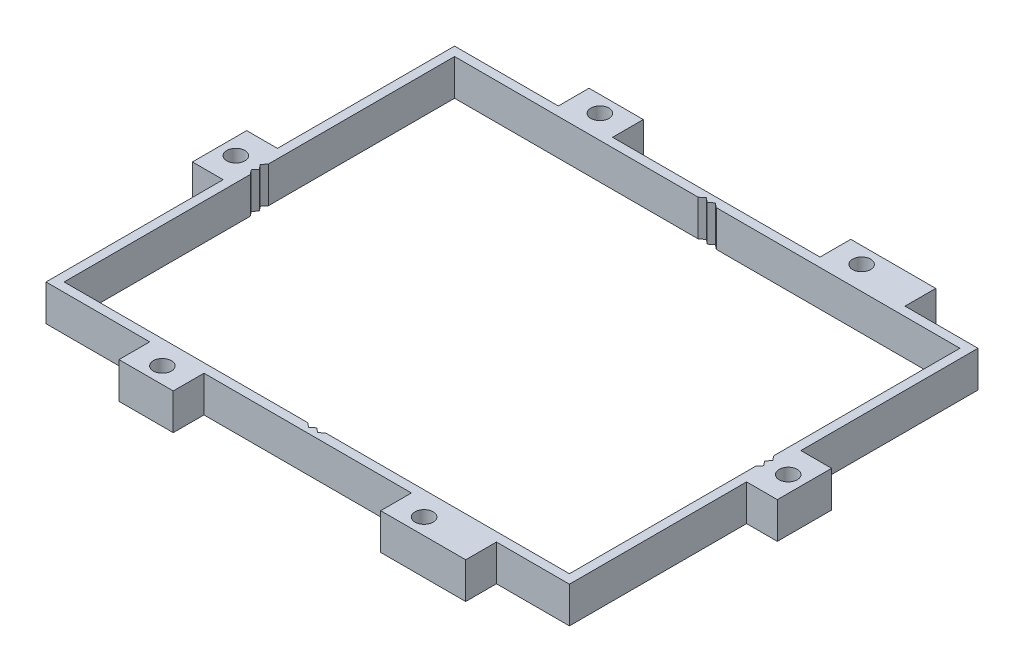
ISO-10303-21;
HEADER;
FILE_DESCRIPTION(('STEP AP214'),'2;1');
FILE_NAME('part.step','',(''),(''),'','','');
FILE_SCHEMA(('AUTOMOTIVE_DESIGN { 1 0 10303 214 1 1 1 1 }'));
ENDSEC;
DATA;
#1=APPLICATION_CONTEXT('core data for automotive mechanical design processes');
#2=APPLICATION_PROTOCOL_DEFINITION('international standard','automotive_design',2000,#1);
#3=PRODUCT_CONTEXT('',#1,'mechanical');
#4=PRODUCT('Part','Part','',(#3));
#5=PRODUCT_RELATED_PRODUCT_CATEGORY('part','',(#4));
#6=PRODUCT_DEFINITION_FORMATION('','',#4);
#7=PRODUCT_DEFINITION_CONTEXT('part definition',#1,'design');
#8=PRODUCT_DEFINITION('design','',#6,#7);
#9=PRODUCT_DEFINITION_SHAPE('','',#8);
#10=(LENGTH_UNIT() NAMED_UNIT(*) SI_UNIT(.MILLI.,.METRE.));
#11=(NAMED_UNIT(*) PLANE_ANGLE_UNIT() SI_UNIT($,.RADIAN.));
#12=(NAMED_UNIT(*) SI_UNIT($,.STERADIAN.) SOLID_ANGLE_UNIT());
#13=UNCERTAINTY_MEASURE_WITH_UNIT(LENGTH_MEASURE(1.E-05),#10,'distance_accuracy_value','');
#14=(GEOMETRIC_REPRESENTATION_CONTEXT(3) GLOBAL_UNCERTAINTY_ASSIGNED_CONTEXT((#13)) GLOBAL_UNIT_ASSIGNED_CONTEXT((#10,
#11,#12)) REPRESENTATION_CONTEXT('',''));
#15=CARTESIAN_POINT('',(0.,0.,0.));
#16=DIRECTION('',(0.,0.,1.));
#17=DIRECTION('',(1.,0.,0.));
#18=AXIS2_PLACEMENT_3D('',#15,#16,#17);
#19=CARTESIAN_POINT('',(-152.7,20.,0.));
#20=DIRECTION('',(0.,-1.,0.));
#21=DIRECTION('',(0.,0.,-1.));
#22=AXIS2_PLACEMENT_3D('',#19,#20,#21);
#23=CYLINDRICAL_SURFACE('',#22,2.);
#24=CARTESIAN_POINT('',(-152.7,0.,0.));
#25=DIRECTION('',(0.,1.,0.));
#26=DIRECTION('',(0.,0.,1.));
#27=AXIS2_PLACEMENT_3D('',#24,#25,#26);
#28=CIRCLE('',#27,2.);
#29=CARTESIAN_POINT('',(-152.7,0.,2.00000000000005));
#30=VERTEX_POINT('',#29);
#31=EDGE_CURVE('E389',#30,#30,#28,.F.);
#32=ORIENTED_EDGE('',*,*,#31,.T.);
#33=EDGE_LOOP('',(#32));
#34=FACE_BOUND('',#33,.T.);
#35=CARTESIAN_POINT('',(-152.7,10.,0.));
#36=DIRECTION('',(0.,1.,0.));
#37=DIRECTION('',(0.,0.,1.));
#38=AXIS2_PLACEMENT_3D('',#35,#36,#37);
#39=CIRCLE('',#38,2.);
#40=CARTESIAN_POINT('',(-152.7,10.,2.00000000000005));
#41=VERTEX_POINT('',#40);
#42=EDGE_CURVE('E1586',#41,#41,#39,.T.);
#43=ORIENTED_EDGE('',*,*,#42,.T.);
#44=EDGE_LOOP('',(#43));
#45=FACE_BOUND('',#44,.T.);
#46=ADVANCED_FACE('F47',(#34,#45),#23,.F.);
#47=CARTESIAN_POINT('',(152.7,20.,0.));
#48=DIRECTION('',(0.,-1.,0.));
#49=DIRECTION('',(0.,0.,-1.));
#50=AXIS2_PLACEMENT_3D('',#47,#48,#49);
#51=CYLINDRICAL_SURFACE('',#50,2.);
#52=CARTESIAN_POINT('',(152.7,0.,0.));
#53=DIRECTION('',(0.,1.,0.));
#54=DIRECTION('',(0.,0.,1.));
#55=AXIS2_PLACEMENT_3D('',#52,#53,#54);
#56=CIRCLE('',#55,2.);
#57=CARTESIAN_POINT('',(152.7,0.,2.));
#58=VERTEX_POINT('',#57);
#59=EDGE_CURVE('E800',#58,#58,#56,.T.);
#60=ORIENTED_EDGE('',*,*,#59,.F.);
#61=EDGE_LOOP('',(#60));
#62=FACE_BOUND('',#61,.T.);
#63=CARTESIAN_POINT('',(152.7,10.,0.));
#64=DIRECTION('',(0.,1.,0.));
#65=DIRECTION('',(0.,0.,1.));
#66=AXIS2_PLACEMENT_3D('',#63,#64,#65);
#67=CIRCLE('',#66,2.);
#68=CARTESIAN_POINT('',(152.7,10.,2.));
#69=VERTEX_POINT('',#68);
#70=EDGE_CURVE('E1590',#69,#69,#67,.T.);
#71=ORIENTED_EDGE('',*,*,#70,.T.);
#72=EDGE_LOOP('',(#71));
#73=FACE_BOUND('',#72,.T.);
#74=ADVANCED_FACE('F985',(#62,#73),#51,.F.);
#75=CARTESIAN_POINT('',(-144.7,20.,0.));
#76=DIRECTION('',(1.,0.,0.));
#77=DIRECTION('',(0.,0.,-1.));
#78=AXIS2_PLACEMENT_3D('',#75,#76,#77);
#79=PLANE('',#78);
#80=DIRECTION('',(0.,-1.,0.));
#81=VECTOR('',#80,1.);
#82=CARTESIAN_POINT('',(-144.7,20.,-14.9999999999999));
#83=LINE('',#82,#81);
#84=CARTESIAN_POINT('',(-144.7,20.,-14.9999999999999));
#85=VERTEX_POINT('',#84);
#86=CARTESIAN_POINT('',(-144.7,0.,-14.9999999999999));
#87=VERTEX_POINT('',#86);
#88=EDGE_CURVE('E381',#85,#87,#83,.T.);
#89=ORIENTED_EDGE('',*,*,#88,.F.);
#90=DIRECTION('',(0.,0.,1.));
#91=VECTOR('',#90,1.);
#92=CARTESIAN_POINT('',(-144.7,20.,0.));
#93=LINE('',#92,#91);
#94=CARTESIAN_POINT('',(-144.7,20.,-112.95));
#95=VERTEX_POINT('',#94);
#96=EDGE_CURVE('E395',#95,#85,#93,.T.);
#97=ORIENTED_EDGE('',*,*,#96,.F.);
#98=DIRECTION('',(0.,-1.,0.));
#99=VECTOR('',#98,1.);
#100=CARTESIAN_POINT('',(-144.7,20.,-112.95));
#101=LINE('',#100,#99);
#102=CARTESIAN_POINT('',(-144.7,0.,-112.95));
#103=VERTEX_POINT('',#102);
#104=EDGE_CURVE('E523',#95,#103,#101,.T.);
#105=ORIENTED_EDGE('',*,*,#104,.T.);
#106=DIRECTION('',(0.,0.,1.));
#107=VECTOR('',#106,1.);
#108=CARTESIAN_POINT('',(-144.7,0.,0.));
#109=LINE('',#108,#107);
#110=EDGE_CURVE('E397',#103,#87,#109,.T.);
#111=ORIENTED_EDGE('',*,*,#110,.T.);
#112=EDGE_LOOP('',(#89,#97,#105,#111));
#113=FACE_BOUND('',#112,.T.);
#114=ADVANCED_FACE('F393',(#113),#79,.F.);
#115=CARTESIAN_POINT('',(144.7,20.,0.));
#116=DIRECTION('',(1.,0.,0.));
#117=DIRECTION('',(0.,0.,-1.));
#118=AXIS2_PLACEMENT_3D('',#115,#116,#117);
#119=PLANE('',#118);
#120=DIRECTION('',(0.,0.,1.));
#121=VECTOR('',#120,1.);
#122=CARTESIAN_POINT('',(144.7,20.,0.));
#123=LINE('',#122,#121);
#124=CARTESIAN_POINT('',(144.7,20.,-112.95));
#125=VERTEX_POINT('',#124);
#126=CARTESIAN_POINT('',(144.7,20.,-15.));
#127=VERTEX_POINT('',#126);
#128=EDGE_CURVE('E729',#125,#127,#123,.T.);
#129=ORIENTED_EDGE('',*,*,#128,.T.);
#130=DIRECTION('',(0.,-1.,0.));
#131=VECTOR('',#130,1.);
#132=CARTESIAN_POINT('',(144.7,20.,-15.));
#133=LINE('',#132,#131);
#134=CARTESIAN_POINT('',(144.7,0.,-15.));
#135=VERTEX_POINT('',#134);
#136=EDGE_CURVE('E816',#127,#135,#133,.T.);
#137=ORIENTED_EDGE('',*,*,#136,.T.);
#138=DIRECTION('',(0.,0.,1.));
#139=VECTOR('',#138,1.);
#140=CARTESIAN_POINT('',(144.7,0.,0.));
#141=LINE('',#140,#139);
#142=CARTESIAN_POINT('',(144.7,0.,-112.95));
#143=VERTEX_POINT('',#142);
#144=EDGE_CURVE('E447',#143,#135,#141,.T.);
#145=ORIENTED_EDGE('',*,*,#144,.F.);
#146=DIRECTION('',(0.,-1.,0.));
#147=VECTOR('',#146,1.);
#148=CARTESIAN_POINT('',(144.7,20.,-112.95));
#149=LINE('',#148,#147);
#150=EDGE_CURVE('E12',#125,#143,#149,.T.);
#151=ORIENTED_EDGE('',*,*,#150,.F.);
#152=EDGE_LOOP('',(#129,#137,#145,#151));
#153=FACE_BOUND('',#152,.T.);
#154=ADVANCED_FACE('F1122',(#153),#119,.T.);
#155=CARTESIAN_POINT('',(0.,20.,-112.95));
#156=DIRECTION('',(0.,0.,1.));
#157=DIRECTION('',(1.,0.,0.));
#158=AXIS2_PLACEMENT_3D('',#155,#156,#157);
#159=PLANE('',#158);
#160=DIRECTION('',(0.,-1.,0.));
#161=VECTOR('',#160,1.);
#162=CARTESIAN_POINT('',(104.35,20.,-112.95));
#163=LINE('',#162,#161);
#164=CARTESIAN_POINT('',(104.35,20.,-112.95));
#165=VERTEX_POINT('',#164);
#166=CARTESIAN_POINT('',(104.35,0.,-112.95));
#167=VERTEX_POINT('',#166);
#168=EDGE_CURVE('E843',#165,#167,#163,.T.);
#169=ORIENTED_EDGE('',*,*,#168,.F.);
#170=DIRECTION('',(-1.,0.,0.));
#171=VECTOR('',#170,1.);
#172=CARTESIAN_POINT('',(0.,20.,-112.95));
#173=LINE('',#172,#171);
#174=EDGE_CURVE('E732',#125,#165,#173,.T.);
#175=ORIENTED_EDGE('',*,*,#174,.F.);
#176=ORIENTED_EDGE('',*,*,#150,.T.);
#177=DIRECTION('',(-1.,0.,0.));
#178=VECTOR('',#177,1.);
#179=CARTESIAN_POINT('',(0.,0.,-112.95));
#180=LINE('',#179,#178);
#181=EDGE_CURVE('E450',#143,#167,#180,.T.);
#182=ORIENTED_EDGE('',*,*,#181,.T.);
#183=EDGE_LOOP('',(#169,#175,#176,#182));
#184=FACE_BOUND('',#183,.T.);
#185=ADVANCED_FACE('F1073',(#184),#159,.F.);
#186=CARTESIAN_POINT('',(72.35,20.,120.95));
#187=DIRECTION('',(0.,-1.,0.));
#188=DIRECTION('',(0.,0.,-1.));
#189=AXIS2_PLACEMENT_3D('',#186,#187,#188);
#190=CYLINDRICAL_SURFACE('',#189,2.);
#191=CARTESIAN_POINT('',(72.35,0.,120.95));
#192=DIRECTION('',(0.,1.,0.));
#193=DIRECTION('',(0.,0.,1.));
#194=AXIS2_PLACEMENT_3D('',#191,#192,#193);
#195=CIRCLE('',#194,2.);
#196=CARTESIAN_POINT('',(72.35,0.,122.95));
#197=VERTEX_POINT('',#196);
#198=EDGE_CURVE('E493',#197,#197,#195,.T.);
#199=ORIENTED_EDGE('',*,*,#198,.F.);
#200=EDGE_LOOP('',(#199));
#201=FACE_BOUND('',#200,.T.);
#202=CARTESIAN_POINT('',(72.35,10.,120.95));
#203=DIRECTION('',(0.,1.,0.));
#204=DIRECTION('',(0.,0.,1.));
#205=AXIS2_PLACEMENT_3D('',#202,#203,#204);
#206=CIRCLE('',#205,2.);
#207=CARTESIAN_POINT('',(72.35,10.,122.95));
#208=VERTEX_POINT('',#207);
#209=EDGE_CURVE('E51',#208,#208,#206,.T.);
#210=ORIENTED_EDGE('',*,*,#209,.T.);
#211=EDGE_LOOP('',(#210));
#212=FACE_BOUND('',#211,.T.);
#213=ADVANCED_FACE('F1071',(#201,#212),#190,.F.);
#214=CARTESIAN_POINT('',(72.35,20.,-120.95));
#215=DIRECTION('',(0.,-1.,0.));
#216=DIRECTION('',(0.,0.,-1.));
#217=AXIS2_PLACEMENT_3D('',#214,#215,#216);
#218=CYLINDRICAL_SURFACE('',#217,2.);
#219=CARTESIAN_POINT('',(72.35,0.,-120.95));
#220=DIRECTION('',(0.,1.,0.));
#221=DIRECTION('',(0.,0.,1.));
#222=AXIS2_PLACEMENT_3D('',#219,#220,#221);
#223=CIRCLE('',#222,2.);
#224=CARTESIAN_POINT('',(72.35,0.,-118.95));
#225=VERTEX_POINT('',#224);
#226=EDGE_CURVE('E499',#225,#225,#223,.F.);
#227=ORIENTED_EDGE('',*,*,#226,.T.);
#228=EDGE_LOOP('',(#227));
#229=FACE_BOUND('',#228,.T.);
#230=CARTESIAN_POINT('',(72.35,10.,-120.95));
#231=DIRECTION('',(0.,1.,0.));
#232=DIRECTION('',(0.,0.,1.));
#233=AXIS2_PLACEMENT_3D('',#230,#231,#232);
#234=CIRCLE('',#233,2.);
#235=CARTESIAN_POINT('',(72.35,10.,-118.95));
#236=VERTEX_POINT('',#235);
#237=EDGE_CURVE('E559',#236,#236,#234,.F.);
#238=ORIENTED_EDGE('',*,*,#237,.F.);
#239=EDGE_LOOP('',(#238));
#240=FACE_BOUND('',#239,.T.);
#241=ADVANCED_FACE('F1064',(#229,#240),#218,.F.);
#242=CARTESIAN_POINT('',(-72.35,20.,120.95));
#243=DIRECTION('',(0.,-1.,0.));
#244=DIRECTION('',(0.,0.,-1.));
#245=AXIS2_PLACEMENT_3D('',#242,#243,#244);
#246=CYLINDRICAL_SURFACE('',#245,2.);
#247=CARTESIAN_POINT('',(-72.35,0.,120.95));
#248=DIRECTION('',(0.,1.,0.));
#249=DIRECTION('',(0.,0.,1.));
#250=AXIS2_PLACEMENT_3D('',#247,#248,#249);
#251=CIRCLE('',#250,2.);
#252=CARTESIAN_POINT('',(-72.35,0.,122.95));
#253=VERTEX_POINT('',#252);
#254=EDGE_CURVE('E490',#253,#253,#251,.F.);
#255=ORIENTED_EDGE('',*,*,#254,.T.);
#256=EDGE_LOOP('',(#255));
#257=FACE_BOUND('',#256,.T.);
#258=CARTESIAN_POINT('',(-72.35,10.,120.95));
#259=DIRECTION('',(0.,1.,0.));
#260=DIRECTION('',(0.,0.,1.));
#261=AXIS2_PLACEMENT_3D('',#258,#259,#260);
#262=CIRCLE('',#261,2.);
#263=CARTESIAN_POINT('',(-72.35,10.,122.95));
#264=VERTEX_POINT('',#263);
#265=EDGE_CURVE('E555',#264,#264,#262,.F.);
#266=ORIENTED_EDGE('',*,*,#265,.F.);
#267=EDGE_LOOP('',(#266));
#268=FACE_BOUND('',#267,.T.);
#269=ADVANCED_FACE('F1058',(#257,#268),#246,.F.);
#270=CARTESIAN_POINT('',(-72.35,20.,-120.95));
#271=DIRECTION('',(0.,-1.,0.));
#272=DIRECTION('',(0.,0.,-1.));
#273=AXIS2_PLACEMENT_3D('',#270,#271,#272);
#274=CYLINDRICAL_SURFACE('',#273,2.);
#275=CARTESIAN_POINT('',(-72.35,0.,-120.95));
#276=DIRECTION('',(0.,1.,0.));
#277=DIRECTION('',(0.,0.,1.));
#278=AXIS2_PLACEMENT_3D('',#275,#276,#277);
#279=CIRCLE('',#278,2.);
#280=CARTESIAN_POINT('',(-72.35,0.,-118.95));
#281=VERTEX_POINT('',#280);
#282=EDGE_CURVE('E496',#281,#281,#279,.T.);
#283=ORIENTED_EDGE('',*,*,#282,.F.);
#284=EDGE_LOOP('',(#283));
#285=FACE_BOUND('',#284,.T.);
#286=CARTESIAN_POINT('',(-72.35,10.,-120.95));
#287=DIRECTION('',(0.,1.,0.));
#288=DIRECTION('',(0.,0.,1.));
#289=AXIS2_PLACEMENT_3D('',#286,#287,#288);
#290=CIRCLE('',#289,2.);
#291=CARTESIAN_POINT('',(-72.35,10.,-118.95));
#292=VERTEX_POINT('',#291);
#293=EDGE_CURVE('E550',#292,#292,#290,.T.);
#294=ORIENTED_EDGE('',*,*,#293,.T.);
#295=EDGE_LOOP('',(#294));
#296=FACE_BOUND('',#295,.T.);
#297=ADVANCED_FACE('F856',(#285,#296),#274,.F.);
#298=CARTESIAN_POINT('',(0.,20.,0.));
#299=DIRECTION('',(0.,1.,0.));
#300=DIRECTION('',(0.,0.,1.));
#301=AXIS2_PLACEMENT_3D('',#298,#299,#300);
#302=PLANE('',#301);
#303=CARTESIAN_POINT('',(-152.7,20.,0.));
#304=DIRECTION('',(0.,1.,0.));
#305=DIRECTION('',(0.,0.,1.));
#306=AXIS2_PLACEMENT_3D('',#303,#304,#305);
#307=CIRCLE('',#306,5.00000000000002);
#308=CARTESIAN_POINT('',(-152.7,20.,5.00000000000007));
#309=VERTEX_POINT('',#308);
#310=EDGE_CURVE('E1591',#309,#309,#307,.T.);
#311=ORIENTED_EDGE('',*,*,#310,.F.);
#312=EDGE_LOOP('',(#311));
#313=FACE_BOUND('',#312,.T.);
#314=CARTESIAN_POINT('',(152.7,20.,0.));
#315=DIRECTION('',(0.,1.,0.));
#316=DIRECTION('',(0.,0.,1.));
#317=AXIS2_PLACEMENT_3D('',#314,#315,#316);
#318=CIRCLE('',#317,5.00000000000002);
#319=CARTESIAN_POINT('',(152.7,20.,5.00000000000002));
#320=VERTEX_POINT('',#319);
#321=EDGE_CURVE('E1594',#320,#320,#318,.T.);
#322=ORIENTED_EDGE('',*,*,#321,.F.);
#323=EDGE_LOOP('',(#322));
#324=FACE_BOUND('',#323,.T.);
#325=CARTESIAN_POINT('',(72.35,20.,120.95));
#326=DIRECTION('',(0.,1.,0.));
#327=DIRECTION('',(0.,0.,-1.));
#328=AXIS2_PLACEMENT_3D('',#325,#326,#327);
#329=CIRCLE('',#328,5.00000000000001);
#330=CARTESIAN_POINT('',(72.35,20.,115.95));
#331=VERTEX_POINT('',#330);
#332=EDGE_CURVE('E575',#331,#331,#329,.T.);
#333=ORIENTED_EDGE('',*,*,#332,.F.);
#334=EDGE_LOOP('',(#333));
#335=FACE_BOUND('',#334,.T.);
#336=CARTESIAN_POINT('',(72.35,20.,-120.95));
#337=DIRECTION('',(0.,-1.,0.));
#338=DIRECTION('',(0.,0.,1.));
#339=AXIS2_PLACEMENT_3D('',#336,#337,#338);
#340=CIRCLE('',#339,5.00000000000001);
#341=CARTESIAN_POINT('',(72.35,20.,-115.95));
#342=VERTEX_POINT('',#341);
#343=EDGE_CURVE('E568',#342,#342,#340,.T.);
#344=ORIENTED_EDGE('',*,*,#343,.T.);
#345=EDGE_LOOP('',(#344));
#346=FACE_BOUND('',#345,.T.);
#347=CARTESIAN_POINT('',(-72.35,20.,120.95));
#348=DIRECTION('',(0.,-1.,0.));
#349=DIRECTION('',(0.,0.,-1.));
#350=AXIS2_PLACEMENT_3D('',#347,#348,#349);
#351=CIRCLE('',#350,5.00000000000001);
#352=CARTESIAN_POINT('',(-72.35,20.,115.95));
#353=VERTEX_POINT('',#352);
#354=EDGE_CURVE('E561',#353,#353,#351,.T.);
#355=ORIENTED_EDGE('',*,*,#354,.T.);
#356=EDGE_LOOP('',(#355));
#357=FACE_BOUND('',#356,.T.);
#358=CARTESIAN_POINT('',(-72.35,20.,-120.95));
#359=DIRECTION('',(0.,1.,0.));
#360=DIRECTION('',(0.,0.,1.));
#361=AXIS2_PLACEMENT_3D('',#358,#359,#360);
#362=CIRCLE('',#361,5.00000000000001);
#363=CARTESIAN_POINT('',(-72.35,20.,-115.95));
#364=VERTEX_POINT('',#363);
#365=EDGE_CURVE('E557',#364,#364,#362,.T.);
#366=ORIENTED_EDGE('',*,*,#365,.F.);
#367=EDGE_LOOP('',(#366));
#368=FACE_BOUND('',#367,.T.);
#369=DIRECTION('',(0.624695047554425,0.,0.78086880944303));
#370=VECTOR('',#369,1.);
#371=CARTESIAN_POINT('',(-141.7,20.,2.5));
#372=LINE('',#371,#370);
#373=CARTESIAN_POINT('',(-141.7,20.,2.5));
#374=VERTEX_POINT('',#373);
#375=CARTESIAN_POINT('',(-139.7,20.,5.));
#376=VERTEX_POINT('',#375);
#377=EDGE_CURVE('E588',#374,#376,#372,.T.);
#378=ORIENTED_EDGE('',*,*,#377,.F.);
#379=DIRECTION('',(-0.624695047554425,0.,0.78086880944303));
#380=VECTOR('',#379,1.);
#381=CARTESIAN_POINT('',(-139.7,20.,0.));
#382=LINE('',#381,#380);
#383=CARTESIAN_POINT('',(-139.7,20.,0.));
#384=VERTEX_POINT('',#383);
#385=EDGE_CURVE('E553',#384,#374,#382,.T.);
#386=ORIENTED_EDGE('',*,*,#385,.F.);
#387=DIRECTION('',(-0.624695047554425,0.,-0.78086880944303));
#388=VECTOR('',#387,1.);
#389=CARTESIAN_POINT('',(-139.7,20.,0.));
#390=LINE('',#389,#388);
#391=CARTESIAN_POINT('',(-141.7,20.,-2.5));
#392=VERTEX_POINT('',#391);
#393=EDGE_CURVE('E649',#384,#392,#390,.T.);
#394=ORIENTED_EDGE('',*,*,#393,.T.);
#395=DIRECTION('',(0.624695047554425,0.,-0.78086880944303));
#396=VECTOR('',#395,1.);
#397=CARTESIAN_POINT('',(-141.7,20.,-2.5));
#398=LINE('',#397,#396);
#399=CARTESIAN_POINT('',(-139.7,20.,-5.));
#400=VERTEX_POINT('',#399);
#401=EDGE_CURVE('E642',#392,#400,#398,.T.);
#402=ORIENTED_EDGE('',*,*,#401,.T.);
#403=DIRECTION('',(0.,0.,1.));
#404=VECTOR('',#403,1.);
#405=CARTESIAN_POINT('',(-139.7,20.,0.));
#406=LINE('',#405,#404);
#407=CARTESIAN_POINT('',(-139.7,20.,-107.95));
#408=VERTEX_POINT('',#407);
#409=EDGE_CURVE('E713',#408,#400,#406,.T.);
#410=ORIENTED_EDGE('',*,*,#409,.F.);
#411=DIRECTION('',(-1.,0.,0.));
#412=VECTOR('',#411,1.);
#413=CARTESIAN_POINT('',(0.,20.,-107.95));
#414=LINE('',#413,#412);
#415=CARTESIAN_POINT('',(-5.00000000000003,20.,-107.95));
#416=VERTEX_POINT('',#415);
#417=EDGE_CURVE('E716',#416,#408,#414,.T.);
#418=ORIENTED_EDGE('',*,*,#417,.F.);
#419=DIRECTION('',(-0.78086880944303,0.,0.624695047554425));
#420=VECTOR('',#419,1.);
#421=CARTESIAN_POINT('',(-5.00000000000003,20.,-107.95));
#422=LINE('',#421,#420);
#423=CARTESIAN_POINT('',(-2.50000000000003,20.,-109.95));
#424=VERTEX_POINT('',#423);
#425=EDGE_CURVE('E699',#424,#416,#422,.T.);
#426=ORIENTED_EDGE('',*,*,#425,.F.);
#427=DIRECTION('',(-0.78086880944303,0.,-0.624695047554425));
#428=VECTOR('',#427,1.);
#429=CARTESIAN_POINT('',(-2.50000000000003,20.,-109.95));
#430=LINE('',#429,#428);
#431=CARTESIAN_POINT('',(0.,20.,-107.95));
#432=VERTEX_POINT('',#431);
#433=EDGE_CURVE('E690',#432,#424,#430,.T.);
#434=ORIENTED_EDGE('',*,*,#433,.F.);
#435=DIRECTION('',(0.78086880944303,0.,-0.624695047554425));
#436=VECTOR('',#435,1.);
#437=CARTESIAN_POINT('',(2.50000000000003,20.,-109.95));
#438=LINE('',#437,#436);
#439=CARTESIAN_POINT('',(2.50000000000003,20.,-109.95));
#440=VERTEX_POINT('',#439);
#441=EDGE_CURVE('E665',#432,#440,#438,.T.);
#442=ORIENTED_EDGE('',*,*,#441,.T.);
#443=DIRECTION('',(0.78086880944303,0.,0.624695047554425));
#444=VECTOR('',#443,1.);
#445=CARTESIAN_POINT('',(5.00000000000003,20.,-107.95));
#446=LINE('',#445,#444);
#447=CARTESIAN_POINT('',(5.00000000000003,20.,-107.95));
#448=VERTEX_POINT('',#447);
#449=EDGE_CURVE('E658',#440,#448,#446,.T.);
#450=ORIENTED_EDGE('',*,*,#449,.T.);
#451=CARTESIAN_POINT('',(139.7,20.,-107.95));
#452=VERTEX_POINT('',#451);
#453=EDGE_CURVE('E717',#452,#448,#414,.T.);
#454=ORIENTED_EDGE('',*,*,#453,.F.);
#455=DIRECTION('',(0.,0.,-1.));
#456=VECTOR('',#455,1.);
#457=CARTESIAN_POINT('',(139.7,20.,0.));
#458=LINE('',#457,#456);
#459=CARTESIAN_POINT('',(139.7,20.,-5.));
#460=VERTEX_POINT('',#459);
#461=EDGE_CURVE('E720',#460,#452,#458,.T.);
#462=ORIENTED_EDGE('',*,*,#461,.F.);
#463=DIRECTION('',(-0.624695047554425,0.,-0.78086880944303));
#464=VECTOR('',#463,1.);
#465=CARTESIAN_POINT('',(141.7,20.,-2.5));
#466=LINE('',#465,#464);
#467=CARTESIAN_POINT('',(141.7,20.,-2.5));
#468=VERTEX_POINT('',#467);
#469=EDGE_CURVE('E680',#468,#460,#466,.T.);
#470=ORIENTED_EDGE('',*,*,#469,.F.);
#471=DIRECTION('',(0.624695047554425,0.,-0.78086880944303));
#472=VECTOR('',#471,1.);
#473=CARTESIAN_POINT('',(139.7,20.,0.));
#474=LINE('',#473,#472);
#475=CARTESIAN_POINT('',(139.7,20.,0.));
#476=VERTEX_POINT('',#475);
#477=EDGE_CURVE('E674',#476,#468,#474,.T.);
#478=ORIENTED_EDGE('',*,*,#477,.F.);
#479=DIRECTION('',(0.624695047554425,0.,0.78086880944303));
#480=VECTOR('',#479,1.);
#481=CARTESIAN_POINT('',(139.7,20.,0.));
#482=LINE('',#481,#480);
#483=CARTESIAN_POINT('',(141.7,20.,2.5));
#484=VERTEX_POINT('',#483);
#485=EDGE_CURVE('E619',#476,#484,#482,.T.);
#486=ORIENTED_EDGE('',*,*,#485,.T.);
#487=DIRECTION('',(-0.624695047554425,0.,0.78086880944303));
#488=VECTOR('',#487,1.);
#489=CARTESIAN_POINT('',(141.7,20.,2.5));
#490=LINE('',#489,#488);
#491=CARTESIAN_POINT('',(139.7,20.,5.));
#492=VERTEX_POINT('',#491);
#493=EDGE_CURVE('E614',#484,#492,#490,.T.);
#494=ORIENTED_EDGE('',*,*,#493,.T.);
#495=CARTESIAN_POINT('',(139.7,20.,107.95));
#496=VERTEX_POINT('',#495);
#497=EDGE_CURVE('E721',#496,#492,#458,.T.);
#498=ORIENTED_EDGE('',*,*,#497,.F.);
#499=DIRECTION('',(-1.,0.,0.));
#500=VECTOR('',#499,1.);
#501=CARTESIAN_POINT('',(0.,20.,107.95));
#502=LINE('',#501,#500);
#503=CARTESIAN_POINT('',(5.00000000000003,20.,107.95));
#504=VERTEX_POINT('',#503);
#505=EDGE_CURVE('E725',#496,#504,#502,.T.);
#506=ORIENTED_EDGE('',*,*,#505,.T.);
#507=DIRECTION('',(0.78086880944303,0.,-0.624695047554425));
#508=VECTOR('',#507,1.);
#509=CARTESIAN_POINT('',(5.00000000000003,20.,107.95));
#510=LINE('',#509,#508);
#511=CARTESIAN_POINT('',(2.50000000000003,20.,109.95));
#512=VERTEX_POINT('',#511);
#513=EDGE_CURVE('E604',#512,#504,#510,.T.);
#514=ORIENTED_EDGE('',*,*,#513,.F.);
#515=DIRECTION('',(0.78086880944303,0.,0.624695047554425));
#516=VECTOR('',#515,1.);
#517=CARTESIAN_POINT('',(2.50000000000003,20.,109.95));
#518=LINE('',#517,#516);
#519=CARTESIAN_POINT('',(0.,20.,107.95));
#520=VERTEX_POINT('',#519);
#521=EDGE_CURVE('E598',#520,#512,#518,.T.);
#522=ORIENTED_EDGE('',*,*,#521,.F.);
#523=DIRECTION('',(-0.78086880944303,0.,0.624695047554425));
#524=VECTOR('',#523,1.);
#525=CARTESIAN_POINT('',(-2.50000000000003,20.,109.95));
#526=LINE('',#525,#524);
#527=CARTESIAN_POINT('',(-2.50000000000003,20.,109.95));
#528=VERTEX_POINT('',#527);
#529=EDGE_CURVE('E633',#520,#528,#526,.T.);
#530=ORIENTED_EDGE('',*,*,#529,.T.);
#531=DIRECTION('',(-0.78086880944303,0.,-0.624695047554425));
#532=VECTOR('',#531,1.);
#533=CARTESIAN_POINT('',(-5.00000000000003,20.,107.95));
#534=LINE('',#533,#532);
#535=CARTESIAN_POINT('',(-5.00000000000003,20.,107.95));
#536=VERTEX_POINT('',#535);
#537=EDGE_CURVE('E628',#528,#536,#534,.T.);
#538=ORIENTED_EDGE('',*,*,#537,.T.);
#539=CARTESIAN_POINT('',(-139.7,20.,107.95));
#540=VERTEX_POINT('',#539);
#541=EDGE_CURVE('E724',#536,#540,#502,.T.);
#542=ORIENTED_EDGE('',*,*,#541,.T.);
#543=EDGE_CURVE('E502',#376,#540,#406,.T.);
#544=ORIENTED_EDGE('',*,*,#543,.F.);
#545=EDGE_LOOP('',(#378,#386,#394,#402,#410,#418,#426,#434,#442,#450,#454,#462,#470,#478,#486,
#494,#498,#506,#514,#522,#530,#538,#542,#544));
#546=FACE_BOUND('',#545,.T.);
#547=ORIENTED_EDGE('',*,*,#128,.F.);
#548=ORIENTED_EDGE('',*,*,#174,.T.);
#549=DIRECTION('',(0.,0.,-1.));
#550=VECTOR('',#549,1.);
#551=CARTESIAN_POINT('',(104.35,20.,0.));
#552=LINE('',#551,#550);
#553=CARTESIAN_POINT('',(104.35,20.,-129.95));
#554=VERTEX_POINT('',#553);
#555=EDGE_CURVE('E835',#165,#554,#552,.T.);
#556=ORIENTED_EDGE('',*,*,#555,.T.);
#557=DIRECTION('',(1.,0.,0.));
#558=VECTOR('',#557,1.);
#559=CARTESIAN_POINT('',(0.,20.,-129.95));
#560=LINE('',#559,#558);
#561=CARTESIAN_POINT('',(57.35,20.,-129.95));
#562=VERTEX_POINT('',#561);
#563=EDGE_CURVE('E735',#562,#554,#560,.T.);
#564=ORIENTED_EDGE('',*,*,#563,.F.);
#565=DIRECTION('',(0.,0.,-1.));
#566=VECTOR('',#565,1.);
#567=CARTESIAN_POINT('',(57.35,20.,0.));
#568=LINE('',#567,#566);
#569=CARTESIAN_POINT('',(57.35,20.,-112.95));
#570=VERTEX_POINT('',#569);
#571=EDGE_CURVE('E738',#570,#562,#568,.T.);
#572=ORIENTED_EDGE('',*,*,#571,.F.);
#573=CARTESIAN_POINT('',(-57.35,20.,-112.95));
#574=VERTEX_POINT('',#573);
#575=EDGE_CURVE('E736',#570,#574,#173,.T.);
#576=ORIENTED_EDGE('',*,*,#575,.T.);
#577=DIRECTION('',(0.,0.,-1.));
#578=VECTOR('',#577,1.);
#579=CARTESIAN_POINT('',(-57.35,20.,0.));
#580=LINE('',#579,#578);
#581=CARTESIAN_POINT('',(-57.35,20.,-129.95));
#582=VERTEX_POINT('',#581);
#583=EDGE_CURVE('E741',#574,#582,#580,.T.);
#584=ORIENTED_EDGE('',*,*,#583,.T.);
#585=DIRECTION('',(-1.,0.,0.));
#586=VECTOR('',#585,1.);
#587=CARTESIAN_POINT('',(0.,20.,-129.95));
#588=LINE('',#587,#586);
#589=CARTESIAN_POINT('',(-87.35,20.,-129.95));
#590=VERTEX_POINT('',#589);
#591=EDGE_CURVE('E743',#582,#590,#588,.T.);
#592=ORIENTED_EDGE('',*,*,#591,.T.);
#593=DIRECTION('',(0.,0.,1.));
#594=VECTOR('',#593,1.);
#595=CARTESIAN_POINT('',(-87.35,20.,0.));
#596=LINE('',#595,#594);
#597=CARTESIAN_POINT('',(-87.35,20.,-112.95));
#598=VERTEX_POINT('',#597);
#599=EDGE_CURVE('E414',#590,#598,#596,.T.);
#600=ORIENTED_EDGE('',*,*,#599,.T.);
#601=EDGE_CURVE('E403',#598,#95,#173,.T.);
#602=ORIENTED_EDGE('',*,*,#601,.T.);
#603=ORIENTED_EDGE('',*,*,#96,.T.);
#604=DIRECTION('',(-1.,0.,0.));
#605=VECTOR('',#604,1.);
#606=CARTESIAN_POINT('',(0.,20.,-14.9999999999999));
#607=LINE('',#606,#605);
#608=CARTESIAN_POINT('',(-161.7,20.,-14.9999999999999));
#609=VERTEX_POINT('',#608);
#610=EDGE_CURVE('E378',#85,#609,#607,.T.);
#611=ORIENTED_EDGE('',*,*,#610,.T.);
#612=DIRECTION('',(0.,0.,1.));
#613=VECTOR('',#612,1.);
#614=CARTESIAN_POINT('',(-161.7,20.,0.));
#615=LINE('',#614,#613);
#616=CARTESIAN_POINT('',(-161.7,20.,15.0000000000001));
#617=VERTEX_POINT('',#616);
#618=EDGE_CURVE('E388',#609,#617,#615,.T.);
#619=ORIENTED_EDGE('',*,*,#618,.T.);
#620=DIRECTION('',(1.,0.,0.));
#621=VECTOR('',#620,1.);
#622=CARTESIAN_POINT('',(0.,20.,15.0000000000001));
#623=LINE('',#622,#621);
#624=CARTESIAN_POINT('',(-144.7,20.,15.0000000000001));
#625=VERTEX_POINT('',#624);
#626=EDGE_CURVE('E786',#617,#625,#623,.T.);
#627=ORIENTED_EDGE('',*,*,#626,.T.);
#628=CARTESIAN_POINT('',(-144.7,20.,112.95));
#629=VERTEX_POINT('',#628);
#630=EDGE_CURVE('E406',#625,#629,#93,.T.);
#631=ORIENTED_EDGE('',*,*,#630,.T.);
#632=DIRECTION('',(-1.,0.,0.));
#633=VECTOR('',#632,1.);
#634=CARTESIAN_POINT('',(0.,20.,112.95));
#635=LINE('',#634,#633);
#636=CARTESIAN_POINT('',(-87.35,20.,112.95));
#637=VERTEX_POINT('',#636);
#638=EDGE_CURVE('E405',#637,#629,#635,.T.);
#639=ORIENTED_EDGE('',*,*,#638,.F.);
#640=DIRECTION('',(0.,0.,-1.));
#641=VECTOR('',#640,1.);
#642=CARTESIAN_POINT('',(-87.35,20.,0.));
#643=LINE('',#642,#641);
#644=CARTESIAN_POINT('',(-87.35,20.,129.95));
#645=VERTEX_POINT('',#644);
#646=EDGE_CURVE('E409',#645,#637,#643,.T.);
#647=ORIENTED_EDGE('',*,*,#646,.F.);
#648=DIRECTION('',(-1.,0.,0.));
#649=VECTOR('',#648,1.);
#650=CARTESIAN_POINT('',(0.,20.,129.95));
#651=LINE('',#650,#649);
#652=CARTESIAN_POINT('',(-57.35,20.,129.95));
#653=VERTEX_POINT('',#652);
#654=EDGE_CURVE('E419',#653,#645,#651,.T.);
#655=ORIENTED_EDGE('',*,*,#654,.F.);
#656=DIRECTION('',(0.,0.,1.));
#657=VECTOR('',#656,1.);
#658=CARTESIAN_POINT('',(-57.35,20.,0.));
#659=LINE('',#658,#657);
#660=CARTESIAN_POINT('',(-57.35,20.,112.95));
#661=VERTEX_POINT('',#660);
#662=EDGE_CURVE('E422',#661,#653,#659,.T.);
#663=ORIENTED_EDGE('',*,*,#662,.F.);
#664=CARTESIAN_POINT('',(57.35,20.,112.95));
#665=VERTEX_POINT('',#664);
#666=EDGE_CURVE('E412',#665,#661,#635,.T.);
#667=ORIENTED_EDGE('',*,*,#666,.F.);
#668=DIRECTION('',(0.,0.,1.));
#669=VECTOR('',#668,1.);
#670=CARTESIAN_POINT('',(57.35,20.,0.));
#671=LINE('',#670,#669);
#672=CARTESIAN_POINT('',(57.35,20.,129.95));
#673=VERTEX_POINT('',#672);
#674=EDGE_CURVE('E425',#665,#673,#671,.T.);
#675=ORIENTED_EDGE('',*,*,#674,.T.);
#676=DIRECTION('',(1.,0.,0.));
#677=VECTOR('',#676,1.);
#678=CARTESIAN_POINT('',(0.,20.,129.95));
#679=LINE('',#678,#677);
#680=CARTESIAN_POINT('',(104.35,20.,129.95));
#681=VERTEX_POINT('',#680);
#682=EDGE_CURVE('E428',#673,#681,#679,.T.);
#683=ORIENTED_EDGE('',*,*,#682,.T.);
#684=DIRECTION('',(0.,0.,1.));
#685=VECTOR('',#684,1.);
#686=CARTESIAN_POINT('',(104.35,20.,0.));
#687=LINE('',#686,#685);
#688=CARTESIAN_POINT('',(104.35,20.,112.95));
#689=VERTEX_POINT('',#688);
#690=EDGE_CURVE('E823',#689,#681,#687,.T.);
#691=ORIENTED_EDGE('',*,*,#690,.F.);
#692=CARTESIAN_POINT('',(144.7,20.,112.95));
#693=VERTEX_POINT('',#692);
#694=EDGE_CURVE('E411',#693,#689,#635,.T.);
#695=ORIENTED_EDGE('',*,*,#694,.F.);
#696=CARTESIAN_POINT('',(144.7,20.,15.));
#697=VERTEX_POINT('',#696);
#698=EDGE_CURVE('E728',#697,#693,#123,.T.);
#699=ORIENTED_EDGE('',*,*,#698,.F.);
#700=DIRECTION('',(-1.,0.,0.));
#701=VECTOR('',#700,1.);
#702=CARTESIAN_POINT('',(0.,20.,15.));
#703=LINE('',#702,#701);
#704=CARTESIAN_POINT('',(161.7,20.,15.));
#705=VERTEX_POINT('',#704);
#706=EDGE_CURVE('E797',#705,#697,#703,.T.);
#707=ORIENTED_EDGE('',*,*,#706,.F.);
#708=DIRECTION('',(0.,0.,1.));
#709=VECTOR('',#708,1.);
#710=CARTESIAN_POINT('',(161.7,20.,0.));
#711=LINE('',#710,#709);
#712=CARTESIAN_POINT('',(161.7,20.,-15.));
#713=VERTEX_POINT('',#712);
#714=EDGE_CURVE('E799',#713,#705,#711,.T.);
#715=ORIENTED_EDGE('',*,*,#714,.F.);
#716=DIRECTION('',(1.,0.,0.));
#717=VECTOR('',#716,1.);
#718=CARTESIAN_POINT('',(0.,20.,-15.));
#719=LINE('',#718,#717);
#720=EDGE_CURVE('E803',#127,#713,#719,.T.);
#721=ORIENTED_EDGE('',*,*,#720,.F.);
#722=EDGE_LOOP('',(#547,#548,#556,#564,#572,#576,#584,#592,#600,#602,#603,#611,#619,#627,#631,
#639,#647,#655,#663,#667,#675,#683,#691,#695,#699,#707,#715,#721));
#723=FACE_BOUND('',#722,.T.);
#724=ADVANCED_FACE('F401',(#313,#324,#335,#346,#357,#368,#546,#723),#302,.T.);
#725=CARTESIAN_POINT('',(0.,0.,0.));
#726=DIRECTION('',(0.,1.,0.));
#727=DIRECTION('',(0.,0.,1.));
#728=AXIS2_PLACEMENT_3D('',#725,#726,#727);
#729=PLANE('',#728);
#730=ORIENTED_EDGE('',*,*,#144,.T.);
#731=DIRECTION('',(1.,0.,0.));
#732=VECTOR('',#731,1.);
#733=CARTESIAN_POINT('',(0.,0.,-15.));
#734=LINE('',#733,#732);
#735=CARTESIAN_POINT('',(161.7,0.,-15.));
#736=VERTEX_POINT('',#735);
#737=EDGE_CURVE('E72',#135,#736,#734,.T.);
#738=ORIENTED_EDGE('',*,*,#737,.T.);
#739=DIRECTION('',(0.,0.,1.));
#740=VECTOR('',#739,1.);
#741=CARTESIAN_POINT('',(161.7,0.,0.));
#742=LINE('',#741,#740);
#743=CARTESIAN_POINT('',(161.7,0.,15.));
#744=VERTEX_POINT('',#743);
#745=EDGE_CURVE('E809',#736,#744,#742,.T.);
#746=ORIENTED_EDGE('',*,*,#745,.T.);
#747=DIRECTION('',(-1.,0.,0.));
#748=VECTOR('',#747,1.);
#749=CARTESIAN_POINT('',(0.,0.,15.));
#750=LINE('',#749,#748);
#751=CARTESIAN_POINT('',(144.7,0.,15.));
#752=VERTEX_POINT('',#751);
#753=EDGE_CURVE('E398',#744,#752,#750,.T.);
#754=ORIENTED_EDGE('',*,*,#753,.T.);
#755=CARTESIAN_POINT('',(144.7,0.,112.95));
#756=VERTEX_POINT('',#755);
#757=EDGE_CURVE('E446',#752,#756,#141,.T.);
#758=ORIENTED_EDGE('',*,*,#757,.T.);
#759=DIRECTION('',(-1.,0.,0.));
#760=VECTOR('',#759,1.);
#761=CARTESIAN_POINT('',(0.,0.,112.95));
#762=LINE('',#761,#760);
#763=CARTESIAN_POINT('',(104.35,0.,112.95));
#764=VERTEX_POINT('',#763);
#765=EDGE_CURVE('E475',#756,#764,#762,.T.);
#766=ORIENTED_EDGE('',*,*,#765,.T.);
#767=DIRECTION('',(0.,0.,1.));
#768=VECTOR('',#767,1.);
#769=CARTESIAN_POINT('',(104.35,0.,0.));
#770=LINE('',#769,#768);
#771=CARTESIAN_POINT('',(104.35,0.,129.95));
#772=VERTEX_POINT('',#771);
#773=EDGE_CURVE('E822',#764,#772,#770,.T.);
#774=ORIENTED_EDGE('',*,*,#773,.T.);
#775=DIRECTION('',(1.,0.,0.));
#776=VECTOR('',#775,1.);
#777=CARTESIAN_POINT('',(0.,0.,129.95));
#778=LINE('',#777,#776);
#779=CARTESIAN_POINT('',(57.35,0.,129.95));
#780=VERTEX_POINT('',#779);
#781=EDGE_CURVE('E488',#780,#772,#778,.T.);
#782=ORIENTED_EDGE('',*,*,#781,.F.);
#783=DIRECTION('',(0.,0.,1.));
#784=VECTOR('',#783,1.);
#785=CARTESIAN_POINT('',(57.35,0.,0.));
#786=LINE('',#785,#784);
#787=CARTESIAN_POINT('',(57.35,0.,112.95));
#788=VERTEX_POINT('',#787);
#789=EDGE_CURVE('E485',#788,#780,#786,.T.);
#790=ORIENTED_EDGE('',*,*,#789,.F.);
#791=CARTESIAN_POINT('',(-57.35,0.,112.95));
#792=VERTEX_POINT('',#791);
#793=EDGE_CURVE('E476',#788,#792,#762,.T.);
#794=ORIENTED_EDGE('',*,*,#793,.T.);
#795=DIRECTION('',(0.,0.,1.));
#796=VECTOR('',#795,1.);
#797=CARTESIAN_POINT('',(-57.35,0.,0.));
#798=LINE('',#797,#796);
#799=CARTESIAN_POINT('',(-57.35,0.,129.95));
#800=VERTEX_POINT('',#799);
#801=EDGE_CURVE('E482',#792,#800,#798,.T.);
#802=ORIENTED_EDGE('',*,*,#801,.T.);
#803=DIRECTION('',(-1.,0.,0.));
#804=VECTOR('',#803,1.);
#805=CARTESIAN_POINT('',(0.,0.,129.95));
#806=LINE('',#805,#804);
#807=CARTESIAN_POINT('',(-87.35,0.,129.95));
#808=VERTEX_POINT('',#807);
#809=EDGE_CURVE('E479',#800,#808,#806,.T.);
#810=ORIENTED_EDGE('',*,*,#809,.T.);
#811=DIRECTION('',(0.,0.,-1.));
#812=VECTOR('',#811,1.);
#813=CARTESIAN_POINT('',(-87.35,0.,0.));
#814=LINE('',#813,#812);
#815=CARTESIAN_POINT('',(-87.35,0.,112.95));
#816=VERTEX_POINT('',#815);
#817=EDGE_CURVE('E474',#808,#816,#814,.T.);
#818=ORIENTED_EDGE('',*,*,#817,.T.);
#819=CARTESIAN_POINT('',(-144.7,0.,112.95));
#820=VERTEX_POINT('',#819);
#821=EDGE_CURVE('E470',#816,#820,#762,.T.);
#822=ORIENTED_EDGE('',*,*,#821,.T.);
#823=CARTESIAN_POINT('',(-144.7,0.,15.0000000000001));
#824=VERTEX_POINT('',#823);
#825=EDGE_CURVE('E471',#824,#820,#109,.T.);
#826=ORIENTED_EDGE('',*,*,#825,.F.);
#827=DIRECTION('',(1.,0.,0.));
#828=VECTOR('',#827,1.);
#829=CARTESIAN_POINT('',(0.,0.,15.0000000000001));
#830=LINE('',#829,#828);
#831=CARTESIAN_POINT('',(-161.7,0.,15.0000000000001));
#832=VERTEX_POINT('',#831);
#833=EDGE_CURVE('E64',#832,#824,#830,.T.);
#834=ORIENTED_EDGE('',*,*,#833,.F.);
#835=DIRECTION('',(0.,0.,1.));
#836=VECTOR('',#835,1.);
#837=CARTESIAN_POINT('',(-161.7,0.,0.));
#838=LINE('',#837,#836);
#839=CARTESIAN_POINT('',(-161.7,0.,-14.9999999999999));
#840=VERTEX_POINT('',#839);
#841=EDGE_CURVE('E1608',#840,#832,#838,.T.);
#842=ORIENTED_EDGE('',*,*,#841,.F.);
#843=DIRECTION('',(-1.,0.,0.));
#844=VECTOR('',#843,1.);
#845=CARTESIAN_POINT('',(0.,0.,-14.9999999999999));
#846=LINE('',#845,#844);
#847=EDGE_CURVE('E1603',#87,#840,#846,.T.);
#848=ORIENTED_EDGE('',*,*,#847,.F.);
#849=ORIENTED_EDGE('',*,*,#110,.F.);
#850=CARTESIAN_POINT('',(-87.35,0.,-112.95));
#851=VERTEX_POINT('',#850);
#852=EDGE_CURVE('E454',#851,#103,#180,.T.);
#853=ORIENTED_EDGE('',*,*,#852,.F.);
#854=DIRECTION('',(0.,0.,1.));
#855=VECTOR('',#854,1.);
#856=CARTESIAN_POINT('',(-87.35,0.,0.));
#857=LINE('',#856,#855);
#858=CARTESIAN_POINT('',(-87.35,0.,-129.95));
#859=VERTEX_POINT('',#858);
#860=EDGE_CURVE('E466',#859,#851,#857,.T.);
#861=ORIENTED_EDGE('',*,*,#860,.F.);
#862=DIRECTION('',(-1.,0.,0.));
#863=VECTOR('',#862,1.);
#864=CARTESIAN_POINT('',(0.,0.,-129.95));
#865=LINE('',#864,#863);
#866=CARTESIAN_POINT('',(-57.35,0.,-129.95));
#867=VERTEX_POINT('',#866);
#868=EDGE_CURVE('E463',#867,#859,#865,.T.);
#869=ORIENTED_EDGE('',*,*,#868,.F.);
#870=DIRECTION('',(0.,0.,-1.));
#871=VECTOR('',#870,1.);
#872=CARTESIAN_POINT('',(-57.35,0.,0.));
#873=LINE('',#872,#871);
#874=CARTESIAN_POINT('',(-57.35,0.,-112.95));
#875=VERTEX_POINT('',#874);
#876=EDGE_CURVE('E460',#875,#867,#873,.T.);
#877=ORIENTED_EDGE('',*,*,#876,.F.);
#878=CARTESIAN_POINT('',(57.35,0.,-112.95));
#879=VERTEX_POINT('',#878);
#880=EDGE_CURVE('E455',#879,#875,#180,.T.);
#881=ORIENTED_EDGE('',*,*,#880,.F.);
#882=DIRECTION('',(0.,0.,-1.));
#883=VECTOR('',#882,1.);
#884=CARTESIAN_POINT('',(57.35,0.,0.));
#885=LINE('',#884,#883);
#886=CARTESIAN_POINT('',(57.35,0.,-129.95));
#887=VERTEX_POINT('',#886);
#888=EDGE_CURVE('E457',#879,#887,#885,.T.);
#889=ORIENTED_EDGE('',*,*,#888,.T.);
#890=DIRECTION('',(1.,0.,0.));
#891=VECTOR('',#890,1.);
#892=CARTESIAN_POINT('',(0.,0.,-129.95));
#893=LINE('',#892,#891);
#894=CARTESIAN_POINT('',(104.35,0.,-129.95));
#895=VERTEX_POINT('',#894);
#896=EDGE_CURVE('E453',#887,#895,#893,.T.);
#897=ORIENTED_EDGE('',*,*,#896,.T.);
#898=DIRECTION('',(0.,0.,-1.));
#899=VECTOR('',#898,1.);
#900=CARTESIAN_POINT('',(104.35,0.,0.));
#901=LINE('',#900,#899);
#902=EDGE_CURVE('E834',#167,#895,#901,.T.);
#903=ORIENTED_EDGE('',*,*,#902,.F.);
#904=ORIENTED_EDGE('',*,*,#181,.F.);
#905=EDGE_LOOP('',(#730,#738,#746,#754,#758,#766,#774,#782,#790,#794,#802,#810,#818,#822,#826,
#834,#842,#848,#849,#853,#861,#869,#877,#881,#889,#897,#903,#904));
#906=FACE_BOUND('',#905,.T.);
#907=ORIENTED_EDGE('',*,*,#254,.F.);
#908=EDGE_LOOP('',(#907));
#909=FACE_BOUND('',#908,.T.);
#910=ORIENTED_EDGE('',*,*,#198,.T.);
#911=EDGE_LOOP('',(#910));
#912=FACE_BOUND('',#911,.T.);
#913=ORIENTED_EDGE('',*,*,#282,.T.);
#914=EDGE_LOOP('',(#913));
#915=FACE_BOUND('',#914,.T.);
#916=ORIENTED_EDGE('',*,*,#226,.F.);
#917=EDGE_LOOP('',(#916));
#918=FACE_BOUND('',#917,.T.);
#919=DIRECTION('',(-0.624695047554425,0.,0.78086880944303));
#920=VECTOR('',#919,1.);
#921=CARTESIAN_POINT('',(-139.7,0.,0.));
#922=LINE('',#921,#920);
#923=CARTESIAN_POINT('',(-139.7,0.,0.));
#924=VERTEX_POINT('',#923);
#925=CARTESIAN_POINT('',(-141.7,0.,2.5));
#926=VERTEX_POINT('',#925);
#927=EDGE_CURVE('E584',#924,#926,#922,.T.);
#928=ORIENTED_EDGE('',*,*,#927,.T.);
#929=DIRECTION('',(0.624695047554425,0.,0.78086880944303));
#930=VECTOR('',#929,1.);
#931=CARTESIAN_POINT('',(-141.7,0.,2.5));
#932=LINE('',#931,#930);
#933=CARTESIAN_POINT('',(-139.7,0.,5.));
#934=VERTEX_POINT('',#933);
#935=EDGE_CURVE('E587',#926,#934,#932,.T.);
#936=ORIENTED_EDGE('',*,*,#935,.T.);
#937=DIRECTION('',(0.,0.,1.));
#938=VECTOR('',#937,1.);
#939=CARTESIAN_POINT('',(-139.7,0.,0.));
#940=LINE('',#939,#938);
#941=CARTESIAN_POINT('',(-139.7,0.,107.95));
#942=VERTEX_POINT('',#941);
#943=EDGE_CURVE('E434',#934,#942,#940,.T.);
#944=ORIENTED_EDGE('',*,*,#943,.T.);
#945=DIRECTION('',(-1.,0.,0.));
#946=VECTOR('',#945,1.);
#947=CARTESIAN_POINT('',(0.,0.,107.95));
#948=LINE('',#947,#946);
#949=CARTESIAN_POINT('',(-5.00000000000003,0.,107.95));
#950=VERTEX_POINT('',#949);
#951=EDGE_CURVE('E442',#950,#942,#948,.T.);
#952=ORIENTED_EDGE('',*,*,#951,.F.);
#953=DIRECTION('',(-0.78086880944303,0.,-0.624695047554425));
#954=VECTOR('',#953,1.);
#955=CARTESIAN_POINT('',(-5.00000000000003,0.,107.95));
#956=LINE('',#955,#954);
#957=CARTESIAN_POINT('',(-2.50000000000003,0.,109.95));
#958=VERTEX_POINT('',#957);
#959=EDGE_CURVE('E630',#958,#950,#956,.T.);
#960=ORIENTED_EDGE('',*,*,#959,.F.);
#961=DIRECTION('',(-0.78086880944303,0.,0.624695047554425));
#962=VECTOR('',#961,1.);
#963=CARTESIAN_POINT('',(-2.50000000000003,0.,109.95));
#964=LINE('',#963,#962);
#965=CARTESIAN_POINT('',(0.,0.,107.95));
#966=VERTEX_POINT('',#965);
#967=EDGE_CURVE('E632',#966,#958,#964,.T.);
#968=ORIENTED_EDGE('',*,*,#967,.F.);
#969=DIRECTION('',(0.78086880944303,0.,0.624695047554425));
#970=VECTOR('',#969,1.);
#971=CARTESIAN_POINT('',(2.50000000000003,0.,109.95));
#972=LINE('',#971,#970);
#973=CARTESIAN_POINT('',(2.50000000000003,0.,109.95));
#974=VERTEX_POINT('',#973);
#975=EDGE_CURVE('E600',#966,#974,#972,.T.);
#976=ORIENTED_EDGE('',*,*,#975,.T.);
#977=DIRECTION('',(0.78086880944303,0.,-0.624695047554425));
#978=VECTOR('',#977,1.);
#979=CARTESIAN_POINT('',(5.00000000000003,0.,107.95));
#980=LINE('',#979,#978);
#981=CARTESIAN_POINT('',(5.00000000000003,0.,107.95));
#982=VERTEX_POINT('',#981);
#983=EDGE_CURVE('E603',#974,#982,#980,.T.);
#984=ORIENTED_EDGE('',*,*,#983,.T.);
#985=CARTESIAN_POINT('',(139.7,0.,107.95));
#986=VERTEX_POINT('',#985);
#987=EDGE_CURVE('E443',#986,#982,#948,.T.);
#988=ORIENTED_EDGE('',*,*,#987,.F.);
#989=DIRECTION('',(0.,0.,-1.));
#990=VECTOR('',#989,1.);
#991=CARTESIAN_POINT('',(139.7,0.,0.));
#992=LINE('',#991,#990);
#993=CARTESIAN_POINT('',(139.7,0.,5.));
#994=VERTEX_POINT('',#993);
#995=EDGE_CURVE('E439',#986,#994,#992,.T.);
#996=ORIENTED_EDGE('',*,*,#995,.T.);
#997=DIRECTION('',(-0.624695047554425,0.,0.78086880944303));
#998=VECTOR('',#997,1.);
#999=CARTESIAN_POINT('',(141.7,0.,2.5));
#1000=LINE('',#999,#998);
#1001=CARTESIAN_POINT('',(141.7,0.,2.5));
#1002=VERTEX_POINT('',#1001);
#1003=EDGE_CURVE('E616',#1002,#994,#1000,.T.);
#1004=ORIENTED_EDGE('',*,*,#1003,.F.);
#1005=DIRECTION('',(0.624695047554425,0.,0.78086880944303));
#1006=VECTOR('',#1005,1.);
#1007=CARTESIAN_POINT('',(139.7,0.,0.));
#1008=LINE('',#1007,#1006);
#1009=CARTESIAN_POINT('',(139.7,0.,0.));
#1010=VERTEX_POINT('',#1009);
#1011=EDGE_CURVE('E618',#1010,#1002,#1008,.T.);
#1012=ORIENTED_EDGE('',*,*,#1011,.F.);
#1013=DIRECTION('',(0.624695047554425,0.,-0.78086880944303));
#1014=VECTOR('',#1013,1.);
#1015=CARTESIAN_POINT('',(139.7,0.,0.));
#1016=LINE('',#1015,#1014);
#1017=CARTESIAN_POINT('',(141.7,0.,-2.5));
#1018=VERTEX_POINT('',#1017);
#1019=EDGE_CURVE('E676',#1010,#1018,#1016,.T.);
#1020=ORIENTED_EDGE('',*,*,#1019,.T.);
#1021=DIRECTION('',(-0.624695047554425,0.,-0.78086880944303));
#1022=VECTOR('',#1021,1.);
#1023=CARTESIAN_POINT('',(141.7,0.,-2.5));
#1024=LINE('',#1023,#1022);
#1025=CARTESIAN_POINT('',(139.7,0.,-5.));
#1026=VERTEX_POINT('',#1025);
#1027=EDGE_CURVE('E679',#1018,#1026,#1024,.T.);
#1028=ORIENTED_EDGE('',*,*,#1027,.T.);
#1029=CARTESIAN_POINT('',(139.7,0.,-107.95));
#1030=VERTEX_POINT('',#1029);
#1031=EDGE_CURVE('E438',#1026,#1030,#992,.T.);
#1032=ORIENTED_EDGE('',*,*,#1031,.T.);
#1033=DIRECTION('',(-1.,0.,0.));
#1034=VECTOR('',#1033,1.);
#1035=CARTESIAN_POINT('',(0.,0.,-107.95));
#1036=LINE('',#1035,#1034);
#1037=CARTESIAN_POINT('',(5.00000000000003,0.,-107.95));
#1038=VERTEX_POINT('',#1037);
#1039=EDGE_CURVE('E435',#1030,#1038,#1036,.T.);
#1040=ORIENTED_EDGE('',*,*,#1039,.T.);
#1041=DIRECTION('',(0.78086880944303,0.,0.624695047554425));
#1042=VECTOR('',#1041,1.);
#1043=CARTESIAN_POINT('',(5.00000000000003,0.,-107.95));
#1044=LINE('',#1043,#1042);
#1045=CARTESIAN_POINT('',(2.50000000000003,0.,-109.95));
#1046=VERTEX_POINT('',#1045);
#1047=EDGE_CURVE('E662',#1046,#1038,#1044,.T.);
#1048=ORIENTED_EDGE('',*,*,#1047,.F.);
#1049=DIRECTION('',(0.78086880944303,0.,-0.624695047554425));
#1050=VECTOR('',#1049,1.);
#1051=CARTESIAN_POINT('',(2.50000000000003,0.,-109.95));
#1052=LINE('',#1051,#1050);
#1053=CARTESIAN_POINT('',(0.,0.,-107.95));
#1054=VERTEX_POINT('',#1053);
#1055=EDGE_CURVE('E664',#1054,#1046,#1052,.T.);
#1056=ORIENTED_EDGE('',*,*,#1055,.F.);
#1057=DIRECTION('',(-0.78086880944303,0.,-0.624695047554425));
#1058=VECTOR('',#1057,1.);
#1059=CARTESIAN_POINT('',(-2.50000000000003,0.,-109.95));
#1060=LINE('',#1059,#1058);
#1061=CARTESIAN_POINT('',(-2.50000000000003,0.,-109.95));
#1062=VERTEX_POINT('',#1061);
#1063=EDGE_CURVE('E695',#1054,#1062,#1060,.T.);
#1064=ORIENTED_EDGE('',*,*,#1063,.T.);
#1065=DIRECTION('',(-0.78086880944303,0.,0.624695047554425));
#1066=VECTOR('',#1065,1.);
#1067=CARTESIAN_POINT('',(-5.00000000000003,0.,-107.95));
#1068=LINE('',#1067,#1066);
#1069=CARTESIAN_POINT('',(-5.00000000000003,0.,-107.95));
#1070=VERTEX_POINT('',#1069);
#1071=EDGE_CURVE('E698',#1062,#1070,#1068,.T.);
#1072=ORIENTED_EDGE('',*,*,#1071,.T.);
#1073=CARTESIAN_POINT('',(-139.7,0.,-107.95));
#1074=VERTEX_POINT('',#1073);
#1075=EDGE_CURVE('E433',#1070,#1074,#1036,.T.);
#1076=ORIENTED_EDGE('',*,*,#1075,.T.);
#1077=CARTESIAN_POINT('',(-139.7,0.,-5.));
#1078=VERTEX_POINT('',#1077);
#1079=EDGE_CURVE('E430',#1074,#1078,#940,.T.);
#1080=ORIENTED_EDGE('',*,*,#1079,.T.);
#1081=DIRECTION('',(0.624695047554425,0.,-0.78086880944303));
#1082=VECTOR('',#1081,1.);
#1083=CARTESIAN_POINT('',(-141.7,0.,-2.5));
#1084=LINE('',#1083,#1082);
#1085=CARTESIAN_POINT('',(-141.7,0.,-2.5));
#1086=VERTEX_POINT('',#1085);
#1087=EDGE_CURVE('E646',#1086,#1078,#1084,.T.);
#1088=ORIENTED_EDGE('',*,*,#1087,.F.);
#1089=DIRECTION('',(-0.624695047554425,0.,-0.78086880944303));
#1090=VECTOR('',#1089,1.);
#1091=CARTESIAN_POINT('',(-139.7,0.,0.));
#1092=LINE('',#1091,#1090);
#1093=EDGE_CURVE('E648',#924,#1086,#1092,.T.);
#1094=ORIENTED_EDGE('',*,*,#1093,.F.);
#1095=EDGE_LOOP('',(#928,#936,#944,#952,#960,#968,#976,#984,#988,#996,#1004,#1012,#1020,#1028,
#1032,#1040,#1048,#1056,#1064,#1072,#1076,#1080,#1088,#1094));
#1096=FACE_BOUND('',#1095,.T.);
#1097=ORIENTED_EDGE('',*,*,#59,.T.);
#1098=EDGE_LOOP('',(#1097));
#1099=FACE_BOUND('',#1098,.T.);
#1100=ORIENTED_EDGE('',*,*,#31,.F.);
#1101=EDGE_LOOP('',(#1100));
#1102=FACE_BOUND('',#1101,.T.);
#1103=ADVANCED_FACE('F777',(#906,#909,#912,#915,#918,#1096,#1099,#1102),#729,.F.);
#1104=CARTESIAN_POINT('',(139.7,20.,0.));
#1105=DIRECTION('',(-1.,0.,0.));
#1106=DIRECTION('',(0.,0.,1.));
#1107=AXIS2_PLACEMENT_3D('',#1104,#1105,#1106);
#1108=PLANE('',#1107);
#1109=ORIENTED_EDGE('',*,*,#497,.T.);
#1110=DIRECTION('',(0.,1.,0.));
#1111=VECTOR('',#1110,1.);
#1112=CARTESIAN_POINT('',(139.7,0.,5.));
#1113=LINE('',#1112,#1111);
#1114=EDGE_CURVE('E621',#994,#492,#1113,.T.);
#1115=ORIENTED_EDGE('',*,*,#1114,.F.);
#1116=ORIENTED_EDGE('',*,*,#995,.F.);
#1117=DIRECTION('',(0.,-1.,0.));
#1118=VECTOR('',#1117,1.);
#1119=CARTESIAN_POINT('',(139.7,20.,107.95));
#1120=LINE('',#1119,#1118);
#1121=EDGE_CURVE('E543',#496,#986,#1120,.T.);
#1122=ORIENTED_EDGE('',*,*,#1121,.F.);
#1123=EDGE_LOOP('',(#1109,#1115,#1116,#1122));
#1124=FACE_BOUND('',#1123,.T.);
#1125=ADVANCED_FACE('F909',(#1124),#1108,.T.);
#1126=CARTESIAN_POINT('',(0.,20.,107.95));
#1127=DIRECTION('',(0.,0.,1.));
#1128=DIRECTION('',(1.,0.,0.));
#1129=AXIS2_PLACEMENT_3D('',#1126,#1127,#1128);
#1130=PLANE('',#1129);
#1131=ORIENTED_EDGE('',*,*,#987,.T.);
#1132=DIRECTION('',(0.,1.,0.));
#1133=VECTOR('',#1132,1.);
#1134=CARTESIAN_POINT('',(5.00000000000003,0.,107.95));
#1135=LINE('',#1134,#1133);
#1136=EDGE_CURVE('E611',#982,#504,#1135,.T.);
#1137=ORIENTED_EDGE('',*,*,#1136,.T.);
#1138=ORIENTED_EDGE('',*,*,#505,.F.);
#1139=ORIENTED_EDGE('',*,*,#1121,.T.);
#1140=EDGE_LOOP('',(#1131,#1137,#1138,#1139));
#1141=FACE_BOUND('',#1140,.T.);
#1142=ADVANCED_FACE('F904',(#1141),#1130,.F.);
#1143=DIRECTION('',(0.,1.,0.));
#1144=VECTOR('',#1143,1.);
#1145=CARTESIAN_POINT('',(-5.00000000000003,0.,107.95));
#1146=LINE('',#1145,#1144);
#1147=EDGE_CURVE('E635',#950,#536,#1146,.T.);
#1148=ORIENTED_EDGE('',*,*,#1147,.F.);
#1149=ORIENTED_EDGE('',*,*,#951,.T.);
#1150=DIRECTION('',(0.,-1.,0.));
#1151=VECTOR('',#1150,1.);
#1152=CARTESIAN_POINT('',(-139.7,20.,107.95));
#1153=LINE('',#1152,#1151);
#1154=EDGE_CURVE('E540',#540,#942,#1153,.T.);
#1155=ORIENTED_EDGE('',*,*,#1154,.F.);
#1156=ORIENTED_EDGE('',*,*,#541,.F.);
#1157=EDGE_LOOP('',(#1148,#1149,#1155,#1156));
#1158=FACE_BOUND('',#1157,.T.);
#1159=ADVANCED_FACE('F883',(#1158),#1130,.F.);
#1160=CARTESIAN_POINT('',(-139.7,20.,0.));
#1161=DIRECTION('',(1.,0.,0.));
#1162=DIRECTION('',(0.,0.,-1.));
#1163=AXIS2_PLACEMENT_3D('',#1160,#1161,#1162);
#1164=PLANE('',#1163);
#1165=DIRECTION('',(0.,1.,0.));
#1166=VECTOR('',#1165,1.);
#1167=CARTESIAN_POINT('',(-139.7,0.,5.));
#1168=LINE('',#1167,#1166);
#1169=EDGE_CURVE('E595',#934,#376,#1168,.T.);
#1170=ORIENTED_EDGE('',*,*,#1169,.T.);
#1171=ORIENTED_EDGE('',*,*,#543,.T.);
#1172=ORIENTED_EDGE('',*,*,#1154,.T.);
#1173=ORIENTED_EDGE('',*,*,#943,.F.);
#1174=EDGE_LOOP('',(#1170,#1171,#1172,#1173));
#1175=FACE_BOUND('',#1174,.T.);
#1176=ADVANCED_FACE('F49',(#1175),#1164,.T.);
#1177=ORIENTED_EDGE('',*,*,#409,.T.);
#1178=DIRECTION('',(0.,1.,0.));
#1179=VECTOR('',#1178,1.);
#1180=CARTESIAN_POINT('',(-139.7,0.,-5.));
#1181=LINE('',#1180,#1179);
#1182=EDGE_CURVE('E651',#1078,#400,#1181,.T.);
#1183=ORIENTED_EDGE('',*,*,#1182,.F.);
#1184=ORIENTED_EDGE('',*,*,#1079,.F.);
#1185=DIRECTION('',(0.,-1.,0.));
#1186=VECTOR('',#1185,1.);
#1187=CARTESIAN_POINT('',(-139.7,20.,-107.95));
#1188=LINE('',#1187,#1186);
#1189=EDGE_CURVE('E507',#408,#1074,#1188,.T.);
#1190=ORIENTED_EDGE('',*,*,#1189,.F.);
#1191=EDGE_LOOP('',(#1177,#1183,#1184,#1190));
#1192=FACE_BOUND('',#1191,.T.);
#1193=ADVANCED_FACE('F960',(#1192),#1164,.T.);
#1194=CARTESIAN_POINT('',(0.,20.,-107.95));
#1195=DIRECTION('',(0.,0.,1.));
#1196=DIRECTION('',(1.,0.,0.));
#1197=AXIS2_PLACEMENT_3D('',#1194,#1195,#1196);
#1198=PLANE('',#1197);
#1199=ORIENTED_EDGE('',*,*,#453,.T.);
#1200=DIRECTION('',(0.,1.,0.));
#1201=VECTOR('',#1200,1.);
#1202=CARTESIAN_POINT('',(5.00000000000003,0.,-107.95));
#1203=LINE('',#1202,#1201);
#1204=EDGE_CURVE('E667',#1038,#448,#1203,.T.);
#1205=ORIENTED_EDGE('',*,*,#1204,.F.);
#1206=ORIENTED_EDGE('',*,*,#1039,.F.);
#1207=DIRECTION('',(0.,-1.,0.));
#1208=VECTOR('',#1207,1.);
#1209=CARTESIAN_POINT('',(139.7,20.,-107.95));
#1210=LINE('',#1209,#1208);
#1211=EDGE_CURVE('E545',#452,#1030,#1210,.T.);
#1212=ORIENTED_EDGE('',*,*,#1211,.F.);
#1213=EDGE_LOOP('',(#1199,#1205,#1206,#1212));
#1214=FACE_BOUND('',#1213,.T.);
#1215=ADVANCED_FACE('F937',(#1214),#1198,.T.);
#1216=DIRECTION('',(0.,1.,0.));
#1217=VECTOR('',#1216,1.);
#1218=CARTESIAN_POINT('',(139.7,0.,-5.));
#1219=LINE('',#1218,#1217);
#1220=EDGE_CURVE('E687',#1026,#460,#1219,.T.);
#1221=ORIENTED_EDGE('',*,*,#1220,.T.);
#1222=ORIENTED_EDGE('',*,*,#461,.T.);
#1223=ORIENTED_EDGE('',*,*,#1211,.T.);
#1224=ORIENTED_EDGE('',*,*,#1031,.F.);
#1225=EDGE_LOOP('',(#1221,#1222,#1223,#1224));
#1226=FACE_BOUND('',#1225,.T.);
#1227=ADVANCED_FACE('F930',(#1226),#1108,.T.);
#1228=DIRECTION('',(0.,1.,0.));
#1229=VECTOR('',#1228,1.);
#1230=CARTESIAN_POINT('',(-5.00000000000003,0.,-107.95));
#1231=LINE('',#1230,#1229);
#1232=EDGE_CURVE('E706',#1070,#416,#1231,.T.);
#1233=ORIENTED_EDGE('',*,*,#1232,.T.);
#1234=ORIENTED_EDGE('',*,*,#417,.T.);
#1235=ORIENTED_EDGE('',*,*,#1189,.T.);
#1236=ORIENTED_EDGE('',*,*,#1075,.F.);
#1237=EDGE_LOOP('',(#1233,#1234,#1235,#1236));
#1238=FACE_BOUND('',#1237,.T.);
#1239=ADVANCED_FACE('F953',(#1238),#1198,.T.);
#1240=DIRECTION('',(0.,-1.,0.));
#1241=VECTOR('',#1240,1.);
#1242=CARTESIAN_POINT('',(144.7,20.,15.));
#1243=LINE('',#1242,#1241);
#1244=EDGE_CURVE('E806',#697,#752,#1243,.T.);
#1245=ORIENTED_EDGE('',*,*,#1244,.F.);
#1246=ORIENTED_EDGE('',*,*,#698,.T.);
#1247=DIRECTION('',(0.,-1.,0.));
#1248=VECTOR('',#1247,1.);
#1249=CARTESIAN_POINT('',(144.7,20.,112.95));
#1250=LINE('',#1249,#1248);
#1251=EDGE_CURVE('E503',#693,#756,#1250,.T.);
#1252=ORIENTED_EDGE('',*,*,#1251,.T.);
#1253=ORIENTED_EDGE('',*,*,#757,.F.);
#1254=EDGE_LOOP('',(#1245,#1246,#1252,#1253));
#1255=FACE_BOUND('',#1254,.T.);
#1256=ADVANCED_FACE('F1117',(#1255),#119,.T.);
#1257=CARTESIAN_POINT('',(0.,20.,-129.95));
#1258=DIRECTION('',(0.,0.,-1.));
#1259=DIRECTION('',(-1.,0.,0.));
#1260=AXIS2_PLACEMENT_3D('',#1257,#1258,#1259);
#1261=PLANE('',#1260);
#1262=ORIENTED_EDGE('',*,*,#896,.F.);
#1263=DIRECTION('',(0.,-1.,0.));
#1264=VECTOR('',#1263,1.);
#1265=CARTESIAN_POINT('',(57.35,20.,-129.95));
#1266=LINE('',#1265,#1264);
#1267=EDGE_CURVE('E56',#562,#887,#1266,.T.);
#1268=ORIENTED_EDGE('',*,*,#1267,.F.);
#1269=ORIENTED_EDGE('',*,*,#563,.T.);
#1270=DIRECTION('',(0.,-1.,0.));
#1271=VECTOR('',#1270,1.);
#1272=CARTESIAN_POINT('',(104.35,20.,-129.95));
#1273=LINE('',#1272,#1271);
#1274=EDGE_CURVE('E838',#554,#895,#1273,.T.);
#1275=ORIENTED_EDGE('',*,*,#1274,.T.);
#1276=EDGE_LOOP('',(#1262,#1268,#1269,#1275));
#1277=FACE_BOUND('',#1276,.T.);
#1278=ADVANCED_FACE('F1113',(#1277),#1261,.T.);
#1279=CARTESIAN_POINT('',(57.35,20.,0.));
#1280=DIRECTION('',(-1.,0.,0.));
#1281=DIRECTION('',(0.,0.,1.));
#1282=AXIS2_PLACEMENT_3D('',#1279,#1280,#1281);
#1283=PLANE('',#1282);
#1284=ORIENTED_EDGE('',*,*,#888,.F.);
#1285=DIRECTION('',(0.,-1.,0.));
#1286=VECTOR('',#1285,1.);
#1287=CARTESIAN_POINT('',(57.35,20.,-112.95));
#1288=LINE('',#1287,#1286);
#1289=EDGE_CURVE('E537',#570,#879,#1288,.T.);
#1290=ORIENTED_EDGE('',*,*,#1289,.F.);
#1291=ORIENTED_EDGE('',*,*,#571,.T.);
#1292=ORIENTED_EDGE('',*,*,#1267,.T.);
#1293=EDGE_LOOP('',(#1284,#1290,#1291,#1292));
#1294=FACE_BOUND('',#1293,.T.);
#1295=ADVANCED_FACE('F1110',(#1294),#1283,.T.);
#1296=ORIENTED_EDGE('',*,*,#880,.T.);
#1297=DIRECTION('',(0.,-1.,0.));
#1298=VECTOR('',#1297,1.);
#1299=CARTESIAN_POINT('',(-57.35,20.,-112.95));
#1300=LINE('',#1299,#1298);
#1301=EDGE_CURVE('E534',#574,#875,#1300,.T.);
#1302=ORIENTED_EDGE('',*,*,#1301,.F.);
#1303=ORIENTED_EDGE('',*,*,#575,.F.);
#1304=ORIENTED_EDGE('',*,*,#1289,.T.);
#1305=EDGE_LOOP('',(#1296,#1302,#1303,#1304));
#1306=FACE_BOUND('',#1305,.T.);
#1307=ADVANCED_FACE('F755',(#1306),#159,.F.);
#1308=CARTESIAN_POINT('',(-57.35,20.,0.));
#1309=DIRECTION('',(-1.,0.,0.));
#1310=DIRECTION('',(0.,0.,1.));
#1311=AXIS2_PLACEMENT_3D('',#1308,#1309,#1310);
#1312=PLANE('',#1311);
#1313=ORIENTED_EDGE('',*,*,#876,.T.);
#1314=DIRECTION('',(0.,-1.,0.));
#1315=VECTOR('',#1314,1.);
#1316=CARTESIAN_POINT('',(-57.35,20.,-129.95));
#1317=LINE('',#1316,#1315);
#1318=EDGE_CURVE('E531',#582,#867,#1317,.T.);
#1319=ORIENTED_EDGE('',*,*,#1318,.F.);
#1320=ORIENTED_EDGE('',*,*,#583,.F.);
#1321=ORIENTED_EDGE('',*,*,#1301,.T.);
#1322=EDGE_LOOP('',(#1313,#1319,#1320,#1321));
#1323=FACE_BOUND('',#1322,.T.);
#1324=ADVANCED_FACE('F758',(#1323),#1312,.F.);
#1325=CARTESIAN_POINT('',(0.,20.,-129.95));
#1326=DIRECTION('',(0.,0.,1.));
#1327=DIRECTION('',(1.,0.,0.));
#1328=AXIS2_PLACEMENT_3D('',#1325,#1326,#1327);
#1329=PLANE('',#1328);
#1330=ORIENTED_EDGE('',*,*,#868,.T.);
#1331=DIRECTION('',(0.,-1.,0.));
#1332=VECTOR('',#1331,1.);
#1333=CARTESIAN_POINT('',(-87.35,20.,-129.95));
#1334=LINE('',#1333,#1332);
#1335=EDGE_CURVE('E528',#590,#859,#1334,.T.);
#1336=ORIENTED_EDGE('',*,*,#1335,.F.);
#1337=ORIENTED_EDGE('',*,*,#591,.F.);
#1338=ORIENTED_EDGE('',*,*,#1318,.T.);
#1339=EDGE_LOOP('',(#1330,#1336,#1337,#1338));
#1340=FACE_BOUND('',#1339,.T.);
#1341=ADVANCED_FACE('F760',(#1340),#1329,.F.);
#1342=CARTESIAN_POINT('',(-87.35,20.,0.));
#1343=DIRECTION('',(1.,0.,0.));
#1344=DIRECTION('',(0.,0.,-1.));
#1345=AXIS2_PLACEMENT_3D('',#1342,#1343,#1344);
#1346=PLANE('',#1345);
#1347=ORIENTED_EDGE('',*,*,#860,.T.);
#1348=DIRECTION('',(0.,-1.,0.));
#1349=VECTOR('',#1348,1.);
#1350=CARTESIAN_POINT('',(-87.35,20.,-112.95));
#1351=LINE('',#1350,#1349);
#1352=EDGE_CURVE('E525',#598,#851,#1351,.T.);
#1353=ORIENTED_EDGE('',*,*,#1352,.F.);
#1354=ORIENTED_EDGE('',*,*,#599,.F.);
#1355=ORIENTED_EDGE('',*,*,#1335,.T.);
#1356=EDGE_LOOP('',(#1347,#1353,#1354,#1355));
#1357=FACE_BOUND('',#1356,.T.);
#1358=ADVANCED_FACE('F762',(#1357),#1346,.F.);
#1359=ORIENTED_EDGE('',*,*,#852,.T.);
#1360=ORIENTED_EDGE('',*,*,#104,.F.);
#1361=ORIENTED_EDGE('',*,*,#601,.F.);
#1362=ORIENTED_EDGE('',*,*,#1352,.T.);
#1363=EDGE_LOOP('',(#1359,#1360,#1361,#1362));
#1364=FACE_BOUND('',#1363,.T.);
#1365=ADVANCED_FACE('F765',(#1364),#159,.F.);
#1366=ORIENTED_EDGE('',*,*,#630,.F.);
#1367=DIRECTION('',(0.,-1.,0.));
#1368=VECTOR('',#1367,1.);
#1369=CARTESIAN_POINT('',(-144.7,20.,15.0000000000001));
#1370=LINE('',#1369,#1368);
#1371=EDGE_CURVE('E772',#625,#824,#1370,.T.);
#1372=ORIENTED_EDGE('',*,*,#1371,.T.);
#1373=ORIENTED_EDGE('',*,*,#825,.T.);
#1374=DIRECTION('',(0.,-1.,0.));
#1375=VECTOR('',#1374,1.);
#1376=CARTESIAN_POINT('',(-144.7,20.,112.95));
#1377=LINE('',#1376,#1375);
#1378=EDGE_CURVE('E520',#629,#820,#1377,.T.);
#1379=ORIENTED_EDGE('',*,*,#1378,.F.);
#1380=EDGE_LOOP('',(#1366,#1372,#1373,#1379));
#1381=FACE_BOUND('',#1380,.T.);
#1382=ADVANCED_FACE('F771',(#1381),#79,.F.);
#1383=CARTESIAN_POINT('',(0.,20.,112.95));
#1384=DIRECTION('',(0.,0.,1.));
#1385=DIRECTION('',(1.,0.,0.));
#1386=AXIS2_PLACEMENT_3D('',#1383,#1384,#1385);
#1387=PLANE('',#1386);
#1388=ORIENTED_EDGE('',*,*,#821,.F.);
#1389=DIRECTION('',(0.,-1.,0.));
#1390=VECTOR('',#1389,1.);
#1391=CARTESIAN_POINT('',(-87.35,20.,112.95));
#1392=LINE('',#1391,#1390);
#1393=EDGE_CURVE('E518',#637,#816,#1392,.T.);
#1394=ORIENTED_EDGE('',*,*,#1393,.F.);
#1395=ORIENTED_EDGE('',*,*,#638,.T.);
#1396=ORIENTED_EDGE('',*,*,#1378,.T.);
#1397=EDGE_LOOP('',(#1388,#1394,#1395,#1396));
#1398=FACE_BOUND('',#1397,.T.);
#1399=ADVANCED_FACE('F775',(#1398),#1387,.T.);
#1400=CARTESIAN_POINT('',(-87.35,20.,0.));
#1401=DIRECTION('',(-1.,0.,0.));
#1402=DIRECTION('',(0.,0.,1.));
#1403=AXIS2_PLACEMENT_3D('',#1400,#1401,#1402);
#1404=PLANE('',#1403);
#1405=ORIENTED_EDGE('',*,*,#817,.F.);
#1406=DIRECTION('',(0.,-1.,0.));
#1407=VECTOR('',#1406,1.);
#1408=CARTESIAN_POINT('',(-87.35,20.,129.95));
#1409=LINE('',#1408,#1407);
#1410=EDGE_CURVE('E516',#645,#808,#1409,.T.);
#1411=ORIENTED_EDGE('',*,*,#1410,.F.);
#1412=ORIENTED_EDGE('',*,*,#646,.T.);
#1413=ORIENTED_EDGE('',*,*,#1393,.T.);
#1414=EDGE_LOOP('',(#1405,#1411,#1412,#1413));
#1415=FACE_BOUND('',#1414,.T.);
#1416=ADVANCED_FACE('F782',(#1415),#1404,.T.);
#1417=CARTESIAN_POINT('',(0.,20.,129.95));
#1418=DIRECTION('',(0.,0.,1.));
#1419=DIRECTION('',(1.,0.,0.));
#1420=AXIS2_PLACEMENT_3D('',#1417,#1418,#1419);
#1421=PLANE('',#1420);
#1422=ORIENTED_EDGE('',*,*,#809,.F.);
#1423=DIRECTION('',(0.,-1.,0.));
#1424=VECTOR('',#1423,1.);
#1425=CARTESIAN_POINT('',(-57.35,20.,129.95));
#1426=LINE('',#1425,#1424);
#1427=EDGE_CURVE('E514',#653,#800,#1426,.T.);
#1428=ORIENTED_EDGE('',*,*,#1427,.F.);
#1429=ORIENTED_EDGE('',*,*,#654,.T.);
#1430=ORIENTED_EDGE('',*,*,#1410,.T.);
#1431=EDGE_LOOP('',(#1422,#1428,#1429,#1430));
#1432=FACE_BOUND('',#1431,.T.);
#1433=ADVANCED_FACE('F1093',(#1432),#1421,.T.);
#1434=CARTESIAN_POINT('',(-57.35,20.,0.));
#1435=DIRECTION('',(1.,0.,0.));
#1436=DIRECTION('',(0.,0.,-1.));
#1437=AXIS2_PLACEMENT_3D('',#1434,#1435,#1436);
#1438=PLANE('',#1437);
#1439=ORIENTED_EDGE('',*,*,#801,.F.);
#1440=DIRECTION('',(0.,-1.,0.));
#1441=VECTOR('',#1440,1.);
#1442=CARTESIAN_POINT('',(-57.35,20.,112.95));
#1443=LINE('',#1442,#1441);
#1444=EDGE_CURVE('E512',#661,#792,#1443,.T.);
#1445=ORIENTED_EDGE('',*,*,#1444,.F.);
#1446=ORIENTED_EDGE('',*,*,#662,.T.);
#1447=ORIENTED_EDGE('',*,*,#1427,.T.);
#1448=EDGE_LOOP('',(#1439,#1445,#1446,#1447));
#1449=FACE_BOUND('',#1448,.T.);
#1450=ADVANCED_FACE('F1090',(#1449),#1438,.T.);
#1451=ORIENTED_EDGE('',*,*,#793,.F.);
#1452=DIRECTION('',(0.,-1.,0.));
#1453=VECTOR('',#1452,1.);
#1454=CARTESIAN_POINT('',(57.35,20.,112.95));
#1455=LINE('',#1454,#1453);
#1456=EDGE_CURVE('E510',#665,#788,#1455,.T.);
#1457=ORIENTED_EDGE('',*,*,#1456,.F.);
#1458=ORIENTED_EDGE('',*,*,#666,.T.);
#1459=ORIENTED_EDGE('',*,*,#1444,.T.);
#1460=EDGE_LOOP('',(#1451,#1457,#1458,#1459));
#1461=FACE_BOUND('',#1460,.T.);
#1462=ADVANCED_FACE('F1082',(#1461),#1387,.T.);
#1463=CARTESIAN_POINT('',(57.35,20.,0.));
#1464=DIRECTION('',(1.,0.,0.));
#1465=DIRECTION('',(0.,0.,-1.));
#1466=AXIS2_PLACEMENT_3D('',#1463,#1464,#1465);
#1467=PLANE('',#1466);
#1468=ORIENTED_EDGE('',*,*,#789,.T.);
#1469=DIRECTION('',(0.,-1.,0.));
#1470=VECTOR('',#1469,1.);
#1471=CARTESIAN_POINT('',(57.35,20.,129.95));
#1472=LINE('',#1471,#1470);
#1473=EDGE_CURVE('E506',#673,#780,#1472,.T.);
#1474=ORIENTED_EDGE('',*,*,#1473,.F.);
#1475=ORIENTED_EDGE('',*,*,#674,.F.);
#1476=ORIENTED_EDGE('',*,*,#1456,.T.);
#1477=EDGE_LOOP('',(#1468,#1474,#1475,#1476));
#1478=FACE_BOUND('',#1477,.T.);
#1479=ADVANCED_FACE('F1085',(#1478),#1467,.F.);
#1480=CARTESIAN_POINT('',(0.,20.,129.95));
#1481=DIRECTION('',(0.,0.,-1.));
#1482=DIRECTION('',(-1.,0.,0.));
#1483=AXIS2_PLACEMENT_3D('',#1480,#1481,#1482);
#1484=PLANE('',#1483);
#1485=ORIENTED_EDGE('',*,*,#781,.T.);
#1486=DIRECTION('',(0.,-1.,0.));
#1487=VECTOR('',#1486,1.);
#1488=CARTESIAN_POINT('',(104.35,20.,129.95));
#1489=LINE('',#1488,#1487);
#1490=EDGE_CURVE('E826',#681,#772,#1489,.T.);
#1491=ORIENTED_EDGE('',*,*,#1490,.F.);
#1492=ORIENTED_EDGE('',*,*,#682,.F.);
#1493=ORIENTED_EDGE('',*,*,#1473,.T.);
#1494=EDGE_LOOP('',(#1485,#1491,#1492,#1493));
#1495=FACE_BOUND('',#1494,.T.);
#1496=ADVANCED_FACE('F1080',(#1495),#1484,.F.);
#1497=DIRECTION('',(0.,-1.,0.));
#1498=VECTOR('',#1497,1.);
#1499=CARTESIAN_POINT('',(104.35,20.,112.95));
#1500=LINE('',#1499,#1498);
#1501=EDGE_CURVE('E831',#689,#764,#1500,.T.);
#1502=ORIENTED_EDGE('',*,*,#1501,.T.);
#1503=ORIENTED_EDGE('',*,*,#765,.F.);
#1504=ORIENTED_EDGE('',*,*,#1251,.F.);
#1505=ORIENTED_EDGE('',*,*,#694,.T.);
#1506=EDGE_LOOP('',(#1502,#1503,#1504,#1505));
#1507=FACE_BOUND('',#1506,.T.);
#1508=ADVANCED_FACE('F1076',(#1507),#1387,.T.);
#1509=CARTESIAN_POINT('',(-5.00000000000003,0.,-107.95));
#1510=DIRECTION('',(-0.624695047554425,0.,-0.78086880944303));
#1511=DIRECTION('',(-0.78086880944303,0.,0.624695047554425));
#1512=AXIS2_PLACEMENT_3D('',#1509,#1510,#1511);
#1513=PLANE('',#1512);
#1514=ORIENTED_EDGE('',*,*,#425,.T.);
#1515=ORIENTED_EDGE('',*,*,#1232,.F.);
#1516=ORIENTED_EDGE('',*,*,#1071,.F.);
#1517=DIRECTION('',(0.,1.,0.));
#1518=VECTOR('',#1517,1.);
#1519=CARTESIAN_POINT('',(-2.50000000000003,0.,-109.95));
#1520=LINE('',#1519,#1518);
#1521=EDGE_CURVE('E709',#1062,#424,#1520,.T.);
#1522=ORIENTED_EDGE('',*,*,#1521,.T.);
#1523=EDGE_LOOP('',(#1514,#1515,#1516,#1522));
#1524=FACE_BOUND('',#1523,.T.);
#1525=ADVANCED_FACE('F1079',(#1524),#1513,.F.);
#1526=CARTESIAN_POINT('',(-2.50000000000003,0.,-109.95));
#1527=DIRECTION('',(0.624695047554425,0.,-0.78086880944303));
#1528=DIRECTION('',(-0.78086880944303,0.,-0.624695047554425));
#1529=AXIS2_PLACEMENT_3D('',#1526,#1527,#1528);
#1530=PLANE('',#1529);
#1531=ORIENTED_EDGE('',*,*,#433,.T.);
#1532=ORIENTED_EDGE('',*,*,#1521,.F.);
#1533=ORIENTED_EDGE('',*,*,#1063,.F.);
#1534=DIRECTION('',(0.,1.,0.));
#1535=VECTOR('',#1534,1.);
#1536=CARTESIAN_POINT('',(0.,0.,-107.95));
#1537=LINE('',#1536,#1535);
#1538=EDGE_CURVE('E702',#1054,#432,#1537,.T.);
#1539=ORIENTED_EDGE('',*,*,#1538,.T.);
#1540=EDGE_LOOP('',(#1531,#1532,#1533,#1539));
#1541=FACE_BOUND('',#1540,.T.);
#1542=ADVANCED_FACE('F948',(#1541),#1530,.F.);
#1543=CARTESIAN_POINT('',(141.7,0.,-2.5));
#1544=DIRECTION('',(0.78086880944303,0.,-0.624695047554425));
#1545=DIRECTION('',(-0.624695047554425,0.,-0.78086880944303));
#1546=AXIS2_PLACEMENT_3D('',#1543,#1544,#1545);
#1547=PLANE('',#1546);
#1548=ORIENTED_EDGE('',*,*,#469,.T.);
#1549=ORIENTED_EDGE('',*,*,#1220,.F.);
#1550=ORIENTED_EDGE('',*,*,#1027,.F.);
#1551=DIRECTION('',(0.,1.,0.));
#1552=VECTOR('',#1551,1.);
#1553=CARTESIAN_POINT('',(141.7,0.,-2.5));
#1554=LINE('',#1553,#1552);
#1555=EDGE_CURVE('E691',#1018,#468,#1554,.T.);
#1556=ORIENTED_EDGE('',*,*,#1555,.T.);
#1557=EDGE_LOOP('',(#1548,#1549,#1550,#1556));
#1558=FACE_BOUND('',#1557,.T.);
#1559=ADVANCED_FACE('F927',(#1558),#1547,.F.);
#1560=CARTESIAN_POINT('',(139.7,0.,0.));
#1561=DIRECTION('',(0.78086880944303,0.,0.624695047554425));
#1562=DIRECTION('',(0.624695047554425,0.,-0.78086880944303));
#1563=AXIS2_PLACEMENT_3D('',#1560,#1561,#1562);
#1564=PLANE('',#1563);
#1565=ORIENTED_EDGE('',*,*,#477,.T.);
#1566=ORIENTED_EDGE('',*,*,#1555,.F.);
#1567=ORIENTED_EDGE('',*,*,#1019,.F.);
#1568=DIRECTION('',(0.,1.,0.));
#1569=VECTOR('',#1568,1.);
#1570=CARTESIAN_POINT('',(139.7,0.,0.));
#1571=LINE('',#1570,#1569);
#1572=EDGE_CURVE('E683',#1010,#476,#1571,.T.);
#1573=ORIENTED_EDGE('',*,*,#1572,.T.);
#1574=EDGE_LOOP('',(#1565,#1566,#1567,#1573));
#1575=FACE_BOUND('',#1574,.T.);
#1576=ADVANCED_FACE('F921',(#1575),#1564,.F.);
#1577=CARTESIAN_POINT('',(2.50000000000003,0.,-109.95));
#1578=DIRECTION('',(0.624695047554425,0.,0.78086880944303));
#1579=DIRECTION('',(0.78086880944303,0.,-0.624695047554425));
#1580=AXIS2_PLACEMENT_3D('',#1577,#1578,#1579);
#1581=PLANE('',#1580);
#1582=ORIENTED_EDGE('',*,*,#441,.F.);
#1583=ORIENTED_EDGE('',*,*,#1538,.F.);
#1584=ORIENTED_EDGE('',*,*,#1055,.T.);
#1585=DIRECTION('',(0.,1.,0.));
#1586=VECTOR('',#1585,1.);
#1587=CARTESIAN_POINT('',(2.50000000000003,0.,-109.95));
#1588=LINE('',#1587,#1586);
#1589=EDGE_CURVE('E672',#1046,#440,#1588,.T.);
#1590=ORIENTED_EDGE('',*,*,#1589,.T.);
#1591=EDGE_LOOP('',(#1582,#1583,#1584,#1590));
#1592=FACE_BOUND('',#1591,.T.);
#1593=ADVANCED_FACE('F945',(#1592),#1581,.T.);
#1594=CARTESIAN_POINT('',(5.00000000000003,0.,-107.95));
#1595=DIRECTION('',(-0.624695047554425,0.,0.78086880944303));
#1596=DIRECTION('',(0.78086880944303,0.,0.624695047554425));
#1597=AXIS2_PLACEMENT_3D('',#1594,#1595,#1596);
#1598=PLANE('',#1597);
#1599=ORIENTED_EDGE('',*,*,#449,.F.);
#1600=ORIENTED_EDGE('',*,*,#1589,.F.);
#1601=ORIENTED_EDGE('',*,*,#1047,.T.);
#1602=ORIENTED_EDGE('',*,*,#1204,.T.);
#1603=EDGE_LOOP('',(#1599,#1600,#1601,#1602));
#1604=FACE_BOUND('',#1603,.T.);
#1605=ADVANCED_FACE('F940',(#1604),#1598,.T.);
#1606=CARTESIAN_POINT('',(-139.7,0.,0.));
#1607=DIRECTION('',(0.78086880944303,0.,-0.624695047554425));
#1608=DIRECTION('',(-0.624695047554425,0.,-0.78086880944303));
#1609=AXIS2_PLACEMENT_3D('',#1606,#1607,#1608);
#1610=PLANE('',#1609);
#1611=ORIENTED_EDGE('',*,*,#393,.F.);
#1612=DIRECTION('',(0.,1.,0.));
#1613=VECTOR('',#1612,1.);
#1614=CARTESIAN_POINT('',(-139.7,0.,0.));
#1615=LINE('',#1614,#1613);
#1616=EDGE_CURVE('E656',#924,#384,#1615,.T.);
#1617=ORIENTED_EDGE('',*,*,#1616,.F.);
#1618=ORIENTED_EDGE('',*,*,#1093,.T.);
#1619=DIRECTION('',(0.,1.,0.));
#1620=VECTOR('',#1619,1.);
#1621=CARTESIAN_POINT('',(-141.7,0.,-2.5));
#1622=LINE('',#1621,#1620);
#1623=EDGE_CURVE('E659',#1086,#392,#1622,.T.);
#1624=ORIENTED_EDGE('',*,*,#1623,.T.);
#1625=EDGE_LOOP('',(#1611,#1617,#1618,#1624));
#1626=FACE_BOUND('',#1625,.T.);
#1627=ADVANCED_FACE('F968',(#1626),#1610,.T.);
#1628=CARTESIAN_POINT('',(-141.7,0.,-2.5));
#1629=DIRECTION('',(0.78086880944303,0.,0.624695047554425));
#1630=DIRECTION('',(0.624695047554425,0.,-0.78086880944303));
#1631=AXIS2_PLACEMENT_3D('',#1628,#1629,#1630);
#1632=PLANE('',#1631);
#1633=ORIENTED_EDGE('',*,*,#401,.F.);
#1634=ORIENTED_EDGE('',*,*,#1623,.F.);
#1635=ORIENTED_EDGE('',*,*,#1087,.T.);
#1636=ORIENTED_EDGE('',*,*,#1182,.T.);
#1637=EDGE_LOOP('',(#1633,#1634,#1635,#1636));
#1638=FACE_BOUND('',#1637,.T.);
#1639=ADVANCED_FACE('F966',(#1638),#1632,.T.);
#1640=CARTESIAN_POINT('',(-2.50000000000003,0.,109.95));
#1641=DIRECTION('',(-0.624695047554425,0.,-0.78086880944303));
#1642=DIRECTION('',(-0.78086880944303,0.,0.624695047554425));
#1643=AXIS2_PLACEMENT_3D('',#1640,#1641,#1642);
#1644=PLANE('',#1643);
#1645=ORIENTED_EDGE('',*,*,#529,.F.);
#1646=DIRECTION('',(0.,1.,0.));
#1647=VECTOR('',#1646,1.);
#1648=CARTESIAN_POINT('',(0.,0.,107.95));
#1649=LINE('',#1648,#1647);
#1650=EDGE_CURVE('E640',#966,#520,#1649,.T.);
#1651=ORIENTED_EDGE('',*,*,#1650,.F.);
#1652=ORIENTED_EDGE('',*,*,#967,.T.);
#1653=DIRECTION('',(0.,1.,0.));
#1654=VECTOR('',#1653,1.);
#1655=CARTESIAN_POINT('',(-2.50000000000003,0.,109.95));
#1656=LINE('',#1655,#1654);
#1657=EDGE_CURVE('E643',#958,#528,#1656,.T.);
#1658=ORIENTED_EDGE('',*,*,#1657,.T.);
#1659=EDGE_LOOP('',(#1645,#1651,#1652,#1658));
#1660=FACE_BOUND('',#1659,.T.);
#1661=ADVANCED_FACE('F894',(#1660),#1644,.T.);
#1662=CARTESIAN_POINT('',(-5.00000000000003,0.,107.95));
#1663=DIRECTION('',(0.624695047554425,0.,-0.78086880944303));
#1664=DIRECTION('',(-0.78086880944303,0.,-0.624695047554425));
#1665=AXIS2_PLACEMENT_3D('',#1662,#1663,#1664);
#1666=PLANE('',#1665);
#1667=ORIENTED_EDGE('',*,*,#537,.F.);
#1668=ORIENTED_EDGE('',*,*,#1657,.F.);
#1669=ORIENTED_EDGE('',*,*,#959,.T.);
#1670=ORIENTED_EDGE('',*,*,#1147,.T.);
#1671=EDGE_LOOP('',(#1667,#1668,#1669,#1670));
#1672=FACE_BOUND('',#1671,.T.);
#1673=ADVANCED_FACE('F887',(#1672),#1666,.T.);
#1674=CARTESIAN_POINT('',(139.7,0.,0.));
#1675=DIRECTION('',(-0.78086880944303,0.,0.624695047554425));
#1676=DIRECTION('',(0.624695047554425,0.,0.78086880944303));
#1677=AXIS2_PLACEMENT_3D('',#1674,#1675,#1676);
#1678=PLANE('',#1677);
#1679=ORIENTED_EDGE('',*,*,#485,.F.);
#1680=ORIENTED_EDGE('',*,*,#1572,.F.);
#1681=ORIENTED_EDGE('',*,*,#1011,.T.);
#1682=DIRECTION('',(0.,1.,0.));
#1683=VECTOR('',#1682,1.);
#1684=CARTESIAN_POINT('',(141.7,0.,2.5));
#1685=LINE('',#1684,#1683);
#1686=EDGE_CURVE('E626',#1002,#484,#1685,.T.);
#1687=ORIENTED_EDGE('',*,*,#1686,.T.);
#1688=EDGE_LOOP('',(#1679,#1680,#1681,#1687));
#1689=FACE_BOUND('',#1688,.T.);
#1690=ADVANCED_FACE('F918',(#1689),#1678,.T.);
#1691=CARTESIAN_POINT('',(141.7,0.,2.5));
#1692=DIRECTION('',(-0.78086880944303,0.,-0.624695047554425));
#1693=DIRECTION('',(-0.624695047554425,0.,0.78086880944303));
#1694=AXIS2_PLACEMENT_3D('',#1691,#1692,#1693);
#1695=PLANE('',#1694);
#1696=ORIENTED_EDGE('',*,*,#493,.F.);
#1697=ORIENTED_EDGE('',*,*,#1686,.F.);
#1698=ORIENTED_EDGE('',*,*,#1003,.T.);
#1699=ORIENTED_EDGE('',*,*,#1114,.T.);
#1700=EDGE_LOOP('',(#1696,#1697,#1698,#1699));
#1701=FACE_BOUND('',#1700,.T.);
#1702=ADVANCED_FACE('F916',(#1701),#1695,.T.);
#1703=CARTESIAN_POINT('',(5.00000000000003,0.,107.95));
#1704=DIRECTION('',(0.624695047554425,0.,0.78086880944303));
#1705=DIRECTION('',(0.78086880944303,0.,-0.624695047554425));
#1706=AXIS2_PLACEMENT_3D('',#1703,#1704,#1705);
#1707=PLANE('',#1706);
#1708=ORIENTED_EDGE('',*,*,#513,.T.);
#1709=ORIENTED_EDGE('',*,*,#1136,.F.);
#1710=ORIENTED_EDGE('',*,*,#983,.F.);
#1711=DIRECTION('',(0.,1.,0.));
#1712=VECTOR('',#1711,1.);
#1713=CARTESIAN_POINT('',(2.50000000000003,0.,109.95));
#1714=LINE('',#1713,#1712);
#1715=EDGE_CURVE('E607',#974,#512,#1714,.T.);
#1716=ORIENTED_EDGE('',*,*,#1715,.T.);
#1717=EDGE_LOOP('',(#1708,#1709,#1710,#1716));
#1718=FACE_BOUND('',#1717,.T.);
#1719=ADVANCED_FACE('F901',(#1718),#1707,.F.);
#1720=CARTESIAN_POINT('',(2.50000000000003,0.,109.95));
#1721=DIRECTION('',(-0.624695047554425,0.,0.78086880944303));
#1722=DIRECTION('',(0.78086880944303,0.,0.624695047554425));
#1723=AXIS2_PLACEMENT_3D('',#1720,#1721,#1722);
#1724=PLANE('',#1723);
#1725=ORIENTED_EDGE('',*,*,#521,.T.);
#1726=ORIENTED_EDGE('',*,*,#1715,.F.);
#1727=ORIENTED_EDGE('',*,*,#975,.F.);
#1728=ORIENTED_EDGE('',*,*,#1650,.T.);
#1729=EDGE_LOOP('',(#1725,#1726,#1727,#1728));
#1730=FACE_BOUND('',#1729,.T.);
#1731=ADVANCED_FACE('F899',(#1730),#1724,.F.);
#1732=CARTESIAN_POINT('',(-141.7,0.,2.5));
#1733=DIRECTION('',(-0.78086880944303,0.,0.624695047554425));
#1734=DIRECTION('',(0.624695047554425,0.,0.78086880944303));
#1735=AXIS2_PLACEMENT_3D('',#1732,#1733,#1734);
#1736=PLANE('',#1735);
#1737=ORIENTED_EDGE('',*,*,#377,.T.);
#1738=ORIENTED_EDGE('',*,*,#1169,.F.);
#1739=ORIENTED_EDGE('',*,*,#935,.F.);
#1740=DIRECTION('',(0.,1.,0.));
#1741=VECTOR('',#1740,1.);
#1742=CARTESIAN_POINT('',(-141.7,0.,2.5));
#1743=LINE('',#1742,#1741);
#1744=EDGE_CURVE('E591',#926,#374,#1743,.T.);
#1745=ORIENTED_EDGE('',*,*,#1744,.T.);
#1746=EDGE_LOOP('',(#1737,#1738,#1739,#1745));
#1747=FACE_BOUND('',#1746,.T.);
#1748=ADVANCED_FACE('F871',(#1747),#1736,.F.);
#1749=CARTESIAN_POINT('',(-139.7,0.,0.));
#1750=DIRECTION('',(-0.78086880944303,0.,-0.624695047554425));
#1751=DIRECTION('',(-0.624695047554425,0.,0.78086880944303));
#1752=AXIS2_PLACEMENT_3D('',#1749,#1750,#1751);
#1753=PLANE('',#1752);
#1754=ORIENTED_EDGE('',*,*,#385,.T.);
#1755=ORIENTED_EDGE('',*,*,#1744,.F.);
#1756=ORIENTED_EDGE('',*,*,#927,.F.);
#1757=ORIENTED_EDGE('',*,*,#1616,.T.);
#1758=EDGE_LOOP('',(#1754,#1755,#1756,#1757));
#1759=FACE_BOUND('',#1758,.T.);
#1760=ADVANCED_FACE('F971',(#1759),#1753,.F.);
#1761=CARTESIAN_POINT('',(-72.35,10.,-120.95));
#1762=DIRECTION('',(0.,1.,0.));
#1763=DIRECTION('',(0.,0.,1.));
#1764=AXIS2_PLACEMENT_3D('',#1761,#1762,#1763);
#1765=CYLINDRICAL_SURFACE('',#1764,5.00000000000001);
#1766=CARTESIAN_POINT('',(-72.35,10.,-120.95));
#1767=DIRECTION('',(0.,1.,0.));
#1768=DIRECTION('',(0.,0.,1.));
#1769=AXIS2_PLACEMENT_3D('',#1766,#1767,#1768);
#1770=CIRCLE('',#1769,5.00000000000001);
#1771=CARTESIAN_POINT('',(-72.35,10.,-115.95));
#1772=VERTEX_POINT('',#1771);
#1773=EDGE_CURVE('E554',#1772,#1772,#1770,.T.);
#1774=ORIENTED_EDGE('',*,*,#1773,.F.);
#1775=EDGE_LOOP('',(#1774));
#1776=FACE_BOUND('',#1775,.T.);
#1777=ORIENTED_EDGE('',*,*,#365,.T.);
#1778=EDGE_LOOP('',(#1777));
#1779=FACE_BOUND('',#1778,.T.);
#1780=ADVANCED_FACE('F973',(#1776,#1779),#1765,.F.);
#1781=CARTESIAN_POINT('',(-72.35,10.,-120.95));
#1782=DIRECTION('',(0.,1.,0.));
#1783=DIRECTION('',(0.,0.,1.));
#1784=AXIS2_PLACEMENT_3D('',#1781,#1782,#1783);
#1785=PLANE('',#1784);
#1786=ORIENTED_EDGE('',*,*,#293,.F.);
#1787=EDGE_LOOP('',(#1786));
#1788=FACE_BOUND('',#1787,.T.);
#1789=ORIENTED_EDGE('',*,*,#1773,.T.);
#1790=EDGE_LOOP('',(#1789));
#1791=FACE_BOUND('',#1790,.T.);
#1792=ADVANCED_FACE('F979',(#1788,#1791),#1785,.T.);
#1793=CARTESIAN_POINT('',(-72.35,10.,120.95));
#1794=DIRECTION('',(0.,1.,0.));
#1795=DIRECTION('',(0.,0.,-1.));
#1796=AXIS2_PLACEMENT_3D('',#1793,#1794,#1795);
#1797=PLANE('',#1796);
#1798=CARTESIAN_POINT('',(-72.35,10.,120.95));
#1799=DIRECTION('',(0.,-1.,0.));
#1800=DIRECTION('',(0.,0.,-1.));
#1801=AXIS2_PLACEMENT_3D('',#1798,#1799,#1800);
#1802=CIRCLE('',#1801,5.00000000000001);
#1803=CARTESIAN_POINT('',(-72.35,10.,115.95));
#1804=VERTEX_POINT('',#1803);
#1805=EDGE_CURVE('E558',#1804,#1804,#1802,.T.);
#1806=ORIENTED_EDGE('',*,*,#1805,.F.);
#1807=EDGE_LOOP('',(#1806));
#1808=FACE_BOUND('',#1807,.T.);
#1809=ORIENTED_EDGE('',*,*,#265,.T.);
#1810=EDGE_LOOP('',(#1809));
#1811=FACE_BOUND('',#1810,.T.);
#1812=ADVANCED_FACE('F1041',(#1808,#1811),#1797,.T.);
#1813=CARTESIAN_POINT('',(-72.35,10.,120.95));
#1814=DIRECTION('',(0.,1.,0.));
#1815=DIRECTION('',(0.,0.,1.));
#1816=AXIS2_PLACEMENT_3D('',#1813,#1814,#1815);
#1817=CYLINDRICAL_SURFACE('',#1816,5.00000000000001);
#1818=ORIENTED_EDGE('',*,*,#1805,.T.);
#1819=EDGE_LOOP('',(#1818));
#1820=FACE_BOUND('',#1819,.T.);
#1821=ORIENTED_EDGE('',*,*,#354,.F.);
#1822=EDGE_LOOP('',(#1821));
#1823=FACE_BOUND('',#1822,.T.);
#1824=ADVANCED_FACE('F1037',(#1820,#1823),#1817,.F.);
#1825=CARTESIAN_POINT('',(72.35,10.,-120.95));
#1826=DIRECTION('',(0.,1.,0.));
#1827=DIRECTION('',(0.,0.,1.));
#1828=AXIS2_PLACEMENT_3D('',#1825,#1826,#1827);
#1829=PLANE('',#1828);
#1830=CARTESIAN_POINT('',(72.35,10.,-120.95));
#1831=DIRECTION('',(0.,-1.,0.));
#1832=DIRECTION('',(0.,0.,1.));
#1833=AXIS2_PLACEMENT_3D('',#1830,#1831,#1832);
#1834=CIRCLE('',#1833,5.00000000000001);
#1835=CARTESIAN_POINT('',(72.35,10.,-115.95));
#1836=VERTEX_POINT('',#1835);
#1837=EDGE_CURVE('E562',#1836,#1836,#1834,.T.);
#1838=ORIENTED_EDGE('',*,*,#1837,.F.);
#1839=EDGE_LOOP('',(#1838));
#1840=FACE_BOUND('',#1839,.T.);
#1841=ORIENTED_EDGE('',*,*,#237,.T.);
#1842=EDGE_LOOP('',(#1841));
#1843=FACE_BOUND('',#1842,.T.);
#1844=ADVANCED_FACE('F1034',(#1840,#1843),#1829,.T.);
#1845=CARTESIAN_POINT('',(72.35,10.,-120.95));
#1846=DIRECTION('',(0.,1.,0.));
#1847=DIRECTION('',(0.,0.,1.));
#1848=AXIS2_PLACEMENT_3D('',#1845,#1846,#1847);
#1849=CYLINDRICAL_SURFACE('',#1848,5.00000000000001);
#1850=ORIENTED_EDGE('',*,*,#1837,.T.);
#1851=EDGE_LOOP('',(#1850));
#1852=FACE_BOUND('',#1851,.T.);
#1853=ORIENTED_EDGE('',*,*,#343,.F.);
#1854=EDGE_LOOP('',(#1853));
#1855=FACE_BOUND('',#1854,.T.);
#1856=ADVANCED_FACE('F1032',(#1852,#1855),#1849,.F.);
#1857=CARTESIAN_POINT('',(72.35,10.,120.95));
#1858=DIRECTION('',(0.,1.,0.));
#1859=DIRECTION('',(0.,0.,1.));
#1860=AXIS2_PLACEMENT_3D('',#1857,#1858,#1859);
#1861=CYLINDRICAL_SURFACE('',#1860,5.00000000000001);
#1862=CARTESIAN_POINT('',(72.35,10.,120.95));
#1863=DIRECTION('',(0.,1.,0.));
#1864=DIRECTION('',(0.,0.,-1.));
#1865=AXIS2_PLACEMENT_3D('',#1862,#1863,#1864);
#1866=CIRCLE('',#1865,5.00000000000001);
#1867=CARTESIAN_POINT('',(72.35,10.,115.95));
#1868=VERTEX_POINT('',#1867);
#1869=EDGE_CURVE('E844',#1868,#1868,#1866,.T.);
#1870=ORIENTED_EDGE('',*,*,#1869,.F.);
#1871=EDGE_LOOP('',(#1870));
#1872=FACE_BOUND('',#1871,.T.);
#1873=ORIENTED_EDGE('',*,*,#332,.T.);
#1874=EDGE_LOOP('',(#1873));
#1875=FACE_BOUND('',#1874,.T.);
#1876=ADVANCED_FACE('F852',(#1872,#1875),#1861,.F.);
#1877=CARTESIAN_POINT('',(72.35,10.,120.95));
#1878=DIRECTION('',(0.,1.,0.));
#1879=DIRECTION('',(0.,0.,-1.));
#1880=AXIS2_PLACEMENT_3D('',#1877,#1878,#1879);
#1881=PLANE('',#1880);
#1882=ORIENTED_EDGE('',*,*,#209,.F.);
#1883=EDGE_LOOP('',(#1882));
#1884=FACE_BOUND('',#1883,.T.);
#1885=ORIENTED_EDGE('',*,*,#1869,.T.);
#1886=EDGE_LOOP('',(#1885));
#1887=FACE_BOUND('',#1886,.T.);
#1888=ADVANCED_FACE('F1025',(#1884,#1887),#1881,.T.);
#1889=CARTESIAN_POINT('',(104.35,20.,0.));
#1890=DIRECTION('',(-1.,0.,0.));
#1891=DIRECTION('',(0.,0.,1.));
#1892=AXIS2_PLACEMENT_3D('',#1889,#1890,#1891);
#1893=PLANE('',#1892);
#1894=ORIENTED_EDGE('',*,*,#902,.T.);
#1895=ORIENTED_EDGE('',*,*,#1274,.F.);
#1896=ORIENTED_EDGE('',*,*,#555,.F.);
#1897=ORIENTED_EDGE('',*,*,#168,.T.);
#1898=EDGE_LOOP('',(#1894,#1895,#1896,#1897));
#1899=FACE_BOUND('',#1898,.T.);
#1900=ADVANCED_FACE('F1021',(#1899),#1893,.F.);
#1901=CARTESIAN_POINT('',(104.35,20.,0.));
#1902=DIRECTION('',(1.,0.,0.));
#1903=DIRECTION('',(0.,0.,-1.));
#1904=AXIS2_PLACEMENT_3D('',#1901,#1902,#1903);
#1905=PLANE('',#1904);
#1906=ORIENTED_EDGE('',*,*,#773,.F.);
#1907=ORIENTED_EDGE('',*,*,#1501,.F.);
#1908=ORIENTED_EDGE('',*,*,#690,.T.);
#1909=ORIENTED_EDGE('',*,*,#1490,.T.);
#1910=EDGE_LOOP('',(#1906,#1907,#1908,#1909));
#1911=FACE_BOUND('',#1910,.T.);
#1912=ADVANCED_FACE('F1017',(#1911),#1905,.T.);
#1913=CARTESIAN_POINT('',(0.,20.,15.));
#1914=DIRECTION('',(0.,0.,1.));
#1915=DIRECTION('',(1.,0.,0.));
#1916=AXIS2_PLACEMENT_3D('',#1913,#1914,#1915);
#1917=PLANE('',#1916);
#1918=ORIENTED_EDGE('',*,*,#753,.F.);
#1919=DIRECTION('',(0.,-1.,0.));
#1920=VECTOR('',#1919,1.);
#1921=CARTESIAN_POINT('',(161.7,20.,15.));
#1922=LINE('',#1921,#1920);
#1923=EDGE_CURVE('E820',#705,#744,#1922,.T.);
#1924=ORIENTED_EDGE('',*,*,#1923,.F.);
#1925=ORIENTED_EDGE('',*,*,#706,.T.);
#1926=ORIENTED_EDGE('',*,*,#1244,.T.);
#1927=EDGE_LOOP('',(#1918,#1924,#1925,#1926));
#1928=FACE_BOUND('',#1927,.T.);
#1929=ADVANCED_FACE('F1013',(#1928),#1917,.T.);
#1930=CARTESIAN_POINT('',(161.7,20.,0.));
#1931=DIRECTION('',(1.,0.,0.));
#1932=DIRECTION('',(0.,0.,-1.));
#1933=AXIS2_PLACEMENT_3D('',#1930,#1931,#1932);
#1934=PLANE('',#1933);
#1935=ORIENTED_EDGE('',*,*,#745,.F.);
#1936=DIRECTION('',(0.,-1.,0.));
#1937=VECTOR('',#1936,1.);
#1938=CARTESIAN_POINT('',(161.7,20.,-15.));
#1939=LINE('',#1938,#1937);
#1940=EDGE_CURVE('E818',#713,#736,#1939,.T.);
#1941=ORIENTED_EDGE('',*,*,#1940,.F.);
#1942=ORIENTED_EDGE('',*,*,#714,.T.);
#1943=ORIENTED_EDGE('',*,*,#1923,.T.);
#1944=EDGE_LOOP('',(#1935,#1941,#1942,#1943));
#1945=FACE_BOUND('',#1944,.T.);
#1946=ADVANCED_FACE('F1010',(#1945),#1934,.T.);
#1947=CARTESIAN_POINT('',(0.,20.,-15.));
#1948=DIRECTION('',(0.,0.,-1.));
#1949=DIRECTION('',(-1.,0.,0.));
#1950=AXIS2_PLACEMENT_3D('',#1947,#1948,#1949);
#1951=PLANE('',#1950);
#1952=ORIENTED_EDGE('',*,*,#737,.F.);
#1953=ORIENTED_EDGE('',*,*,#136,.F.);
#1954=ORIENTED_EDGE('',*,*,#720,.T.);
#1955=ORIENTED_EDGE('',*,*,#1940,.T.);
#1956=EDGE_LOOP('',(#1952,#1953,#1954,#1955));
#1957=FACE_BOUND('',#1956,.T.);
#1958=ADVANCED_FACE('F1006',(#1957),#1951,.T.);
#1959=CARTESIAN_POINT('',(0.,20.,-14.9999999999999));
#1960=DIRECTION('',(0.,0.,1.));
#1961=DIRECTION('',(1.,0.,0.));
#1962=AXIS2_PLACEMENT_3D('',#1959,#1960,#1961);
#1963=PLANE('',#1962);
#1964=ORIENTED_EDGE('',*,*,#847,.T.);
#1965=DIRECTION('',(0.,-1.,0.));
#1966=VECTOR('',#1965,1.);
#1967=CARTESIAN_POINT('',(-161.7,20.,-14.9999999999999));
#1968=LINE('',#1967,#1966);
#1969=EDGE_CURVE('E384',#609,#840,#1968,.T.);
#1970=ORIENTED_EDGE('',*,*,#1969,.F.);
#1971=ORIENTED_EDGE('',*,*,#610,.F.);
#1972=ORIENTED_EDGE('',*,*,#88,.T.);
#1973=EDGE_LOOP('',(#1964,#1970,#1971,#1972));
#1974=FACE_BOUND('',#1973,.T.);
#1975=ADVANCED_FACE('F380',(#1974),#1963,.F.);
#1976=CARTESIAN_POINT('',(-161.7,20.,0.));
#1977=DIRECTION('',(1.,0.,0.));
#1978=DIRECTION('',(0.,0.,-1.));
#1979=AXIS2_PLACEMENT_3D('',#1976,#1977,#1978);
#1980=PLANE('',#1979);
#1981=ORIENTED_EDGE('',*,*,#841,.T.);
#1982=DIRECTION('',(0.,-1.,0.));
#1983=VECTOR('',#1982,1.);
#1984=CARTESIAN_POINT('',(-161.7,20.,15.0000000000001));
#1985=LINE('',#1984,#1983);
#1986=EDGE_CURVE('E790',#617,#832,#1985,.T.);
#1987=ORIENTED_EDGE('',*,*,#1986,.F.);
#1988=ORIENTED_EDGE('',*,*,#618,.F.);
#1989=ORIENTED_EDGE('',*,*,#1969,.T.);
#1990=EDGE_LOOP('',(#1981,#1987,#1988,#1989));
#1991=FACE_BOUND('',#1990,.T.);
#1992=ADVANCED_FACE('F1001',(#1991),#1980,.F.);
#1993=CARTESIAN_POINT('',(0.,20.,15.0000000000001));
#1994=DIRECTION('',(0.,0.,-1.));
#1995=DIRECTION('',(-1.,0.,0.));
#1996=AXIS2_PLACEMENT_3D('',#1993,#1994,#1995);
#1997=PLANE('',#1996);
#1998=ORIENTED_EDGE('',*,*,#833,.T.);
#1999=ORIENTED_EDGE('',*,*,#1371,.F.);
#2000=ORIENTED_EDGE('',*,*,#626,.F.);
#2001=ORIENTED_EDGE('',*,*,#1986,.T.);
#2002=EDGE_LOOP('',(#1998,#1999,#2000,#2001));
#2003=FACE_BOUND('',#2002,.T.);
#2004=ADVANCED_FACE('F789',(#2003),#1997,.F.);
#2005=CARTESIAN_POINT('',(152.7,10.,0.));
#2006=DIRECTION('',(0.,1.,0.));
#2007=DIRECTION('',(0.,0.,1.));
#2008=AXIS2_PLACEMENT_3D('',#2005,#2006,#2007);
#2009=CYLINDRICAL_SURFACE('',#2008,5.00000000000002);
#2010=CARTESIAN_POINT('',(152.7,10.,0.));
#2011=DIRECTION('',(0.,1.,0.));
#2012=DIRECTION('',(0.,0.,1.));
#2013=AXIS2_PLACEMENT_3D('',#2010,#2011,#2012);
#2014=CIRCLE('',#2013,5.00000000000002);
#2015=CARTESIAN_POINT('',(152.7,10.,5.00000000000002));
#2016=VERTEX_POINT('',#2015);
#2017=EDGE_CURVE('E1600',#2016,#2016,#2014,.T.);
#2018=ORIENTED_EDGE('',*,*,#2017,.F.);
#2019=EDGE_LOOP('',(#2018));
#2020=FACE_BOUND('',#2019,.T.);
#2021=ORIENTED_EDGE('',*,*,#321,.T.);
#2022=EDGE_LOOP('',(#2021));
#2023=FACE_BOUND('',#2022,.T.);
#2024=ADVANCED_FACE('F997',(#2020,#2023),#2009,.F.);
#2025=CARTESIAN_POINT('',(152.7,10.,0.));
#2026=DIRECTION('',(0.,1.,0.));
#2027=DIRECTION('',(0.,0.,1.));
#2028=AXIS2_PLACEMENT_3D('',#2025,#2026,#2027);
#2029=PLANE('',#2028);
#2030=ORIENTED_EDGE('',*,*,#70,.F.);
#2031=EDGE_LOOP('',(#2030));
#2032=FACE_BOUND('',#2031,.T.);
#2033=ORIENTED_EDGE('',*,*,#2017,.T.);
#2034=EDGE_LOOP('',(#2033));
#2035=FACE_BOUND('',#2034,.T.);
#2036=ADVANCED_FACE('F1544',(#2032,#2035),#2029,.T.);
#2037=CARTESIAN_POINT('',(-152.7,10.,0.));
#2038=DIRECTION('',(0.,1.,0.));
#2039=DIRECTION('',(0.,0.,1.));
#2040=AXIS2_PLACEMENT_3D('',#2037,#2038,#2039);
#2041=CYLINDRICAL_SURFACE('',#2040,5.00000000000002);
#2042=CARTESIAN_POINT('',(-152.7,10.,0.));
#2043=DIRECTION('',(0.,1.,0.));
#2044=DIRECTION('',(0.,0.,1.));
#2045=AXIS2_PLACEMENT_3D('',#2042,#2043,#2044);
#2046=CIRCLE('',#2045,5.00000000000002);
#2047=CARTESIAN_POINT('',(-152.7,10.,5.00000000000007));
#2048=VERTEX_POINT('',#2047);
#2049=EDGE_CURVE('E1589',#2048,#2048,#2046,.T.);
#2050=ORIENTED_EDGE('',*,*,#2049,.F.);
#2051=EDGE_LOOP('',(#2050));
#2052=FACE_BOUND('',#2051,.T.);
#2053=ORIENTED_EDGE('',*,*,#310,.T.);
#2054=EDGE_LOOP('',(#2053));
#2055=FACE_BOUND('',#2054,.T.);
#2056=ADVANCED_FACE('F1552',(#2052,#2055),#2041,.F.);
#2057=CARTESIAN_POINT('',(-152.7,10.,0.));
#2058=DIRECTION('',(0.,1.,0.));
#2059=DIRECTION('',(0.,0.,1.));
#2060=AXIS2_PLACEMENT_3D('',#2057,#2058,#2059);
#2061=PLANE('',#2060);
#2062=ORIENTED_EDGE('',*,*,#42,.F.);
#2063=EDGE_LOOP('',(#2062));
#2064=FACE_BOUND('',#2063,.T.);
#2065=ORIENTED_EDGE('',*,*,#2049,.T.);
#2066=EDGE_LOOP('',(#2065));
#2067=FACE_BOUND('',#2066,.T.);
#2068=ADVANCED_FACE('F1560',(#2064,#2067),#2061,.T.);
#2069=CLOSED_SHELL('',(#46,#74,#114,#154,#185,#213,#241,#269,#297,#724,#1103,#1125,#1142,#1159,
#1176,#1193,#1215,#1227,#1239,#1256,#1278,#1295,#1307,#1324,#1341,#1358,#1365,#1382,#1399,#1416,
#1433,#1450,#1462,#1479,#1496,#1508,#1525,#1542,#1559,#1576,#1593,#1605,#1627,#1639,#1661,#1673,
#1690,#1702,#1719,#1731,#1748,#1760,#1780,#1792,#1812,#1824,#1844,#1856,#1876,#1888,#1900,#1912,
#1929,#1946,#1958,#1975,#1992,#2004,#2024,#2036,#2056,#2068));
#2070=MANIFOLD_SOLID_BREP('B2',#2069);
#2071=ADVANCED_BREP_SHAPE_REPRESENTATION('',(#18,#2070),#14);
#2072=SHAPE_DEFINITION_REPRESENTATION(#9,#2071);
ENDSEC;
END-ISO-10303-21;
